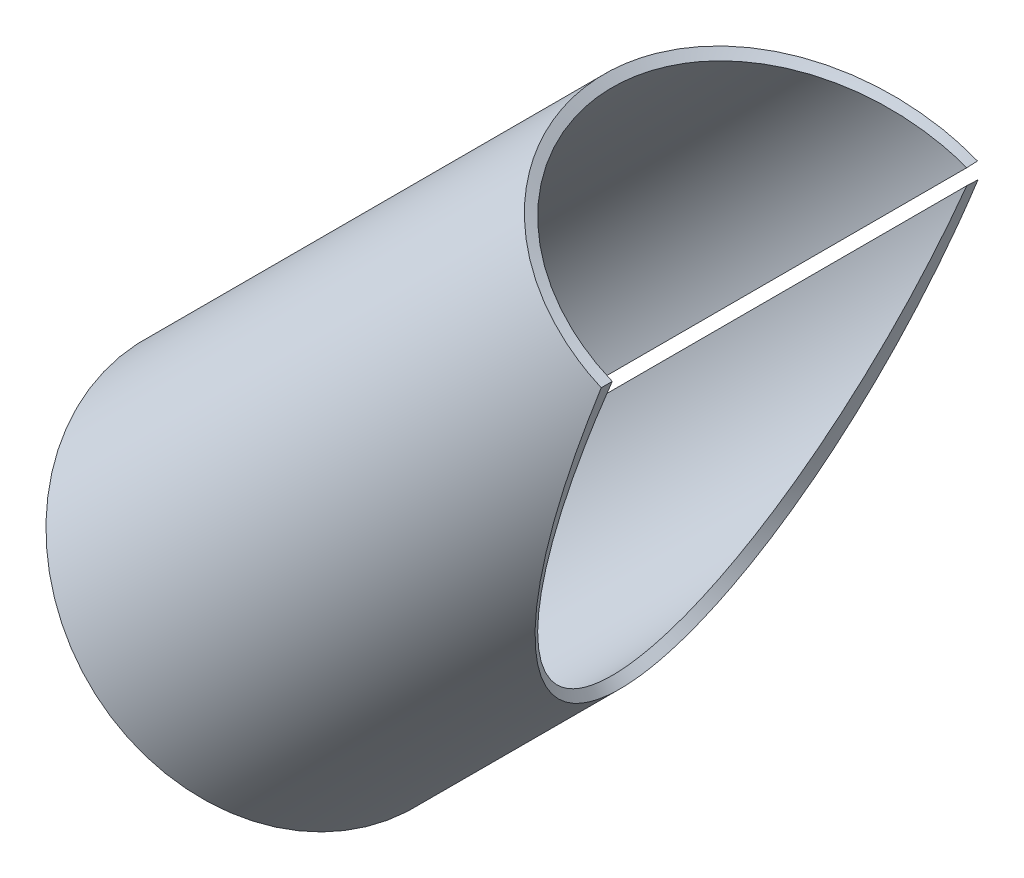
ISO-10303-21;
HEADER;
FILE_DESCRIPTION(('STEP AP214'),'2;1');
FILE_NAME('part.step','',(''),(''),'','','');
FILE_SCHEMA(('AUTOMOTIVE_DESIGN { 1 0 10303 214 1 1 1 1 }'));
ENDSEC;
DATA;
#1=APPLICATION_CONTEXT('core data for automotive mechanical design processes');
#2=APPLICATION_PROTOCOL_DEFINITION('international standard','automotive_design',2000,#1);
#3=PRODUCT_CONTEXT('',#1,'mechanical');
#4=PRODUCT('Part','Part','',(#3));
#5=PRODUCT_RELATED_PRODUCT_CATEGORY('part','',(#4));
#6=PRODUCT_DEFINITION_FORMATION('','',#4);
#7=PRODUCT_DEFINITION_CONTEXT('part definition',#1,'design');
#8=PRODUCT_DEFINITION('design','',#6,#7);
#9=PRODUCT_DEFINITION_SHAPE('','',#8);
#10=(LENGTH_UNIT() NAMED_UNIT(*) SI_UNIT(.MILLI.,.METRE.));
#11=(NAMED_UNIT(*) PLANE_ANGLE_UNIT() SI_UNIT($,.RADIAN.));
#12=(NAMED_UNIT(*) SI_UNIT($,.STERADIAN.) SOLID_ANGLE_UNIT());
#13=UNCERTAINTY_MEASURE_WITH_UNIT(LENGTH_MEASURE(1.E-05),#10,'distance_accuracy_value','');
#14=(GEOMETRIC_REPRESENTATION_CONTEXT(3) GLOBAL_UNCERTAINTY_ASSIGNED_CONTEXT((#13)) GLOBAL_UNIT_ASSIGNED_CONTEXT((#10,
#11,#12)) REPRESENTATION_CONTEXT('',''));
#15=CARTESIAN_POINT('',(0.,0.,0.));
#16=DIRECTION('',(0.,0.,1.));
#17=DIRECTION('',(1.,0.,0.));
#18=AXIS2_PLACEMENT_3D('',#15,#16,#17);
#19=CARTESIAN_POINT('',(-0.47839322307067,-1.22871355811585,-17.354970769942));
#20=CARTESIAN_POINT('',(-1.06470846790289,-2.7347071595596,-17.3350902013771));
#21=CARTESIAN_POINT('',(-1.5784804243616,-4.05532095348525,-17.2815846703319));
#22=CARTESIAN_POINT('',(-2.24140156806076,-5.75741045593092,-17.1859346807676));
#23=CARTESIAN_POINT('',(-2.44436622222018,-6.27833709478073,-17.1513858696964));
#24=CARTESIAN_POINT('',(-2.67541125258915,-6.87159919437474,-17.1077527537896));
#25=CARTESIAN_POINT('',(-2.72043684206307,-6.98723120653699,-17.0990149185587));
#26=CARTESIAN_POINT('',(-2.81056451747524,-7.21869836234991,-17.0810788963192));
#27=CARTESIAN_POINT('',(-2.85537545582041,-7.33378882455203,-17.0719341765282));
#28=CARTESIAN_POINT('',(-2.98905117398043,-7.6771292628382,-17.0439895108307));
#29=CARTESIAN_POINT('',(-3.07715892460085,-7.90344822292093,-17.024679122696));
#30=CARTESIAN_POINT('',(-3.51266788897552,-9.02215251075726,-16.9249819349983));
#31=CARTESIAN_POINT('',(-3.84499884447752,-9.87584719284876,-16.8351810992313));
#32=CARTESIAN_POINT('',(-4.31946970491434,-11.094397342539,-16.6901101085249));
#33=CARTESIAN_POINT('',(-4.47361854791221,-11.4902525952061,-16.6400204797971));
#34=CARTESIAN_POINT('',(-4.77387356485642,-12.2613332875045,-16.5371046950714));
#35=CARTESIAN_POINT('',(-4.91944011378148,-12.6351923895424,-16.4844908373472));
#36=CARTESIAN_POINT('',(-5.637711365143,-14.4801528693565,-16.2122108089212));
#37=CARTESIAN_POINT('',(-6.17670202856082,-15.8646910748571,-15.9664945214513));
#38=CARTESIAN_POINT('',(-6.93194289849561,-17.8041587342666,-15.5714230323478));
#39=CARTESIAN_POINT('',(-7.17416444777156,-18.4262287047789,-15.4356943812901));
#40=CARTESIAN_POINT('',(-7.64705217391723,-19.6408786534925,-15.1538509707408));
#41=CARTESIAN_POINT('',(-7.87709491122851,-20.2317899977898,-15.0080407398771));
#42=CARTESIAN_POINT('',(-8.32442503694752,-21.380738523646,-14.7080546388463));
#43=CARTESIAN_POINT('',(-8.54171218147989,-21.9387759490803,-14.5538789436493));
#44=CARTESIAN_POINT('',(-8.96350448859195,-23.0220032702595,-14.2385166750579));
#45=CARTESIAN_POINT('',(-9.16762390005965,-23.5462277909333,-14.0776444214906));
#46=CARTESIAN_POINT('',(-9.76387695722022,-25.0778219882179,-13.583844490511));
#47=CARTESIAN_POINT('',(-10.1403882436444,-26.0450871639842,-13.2393083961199));
#48=CARTESIAN_POINT('',(-10.6738347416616,-27.4151227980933,-12.7047930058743));
#49=CARTESIAN_POINT('',(-10.8464249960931,-27.8583294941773,-12.5236660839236));
#50=CARTESIAN_POINT('',(-11.1811244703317,-28.7178297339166,-12.1563417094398));
#51=CARTESIAN_POINT('',(-11.3430615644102,-29.1336963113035,-11.9703529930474));
#52=CARTESIAN_POINT('',(-11.8152078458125,-30.3464859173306,-11.4033826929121));
#53=CARTESIAN_POINT('',(-12.1113227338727,-31.1072926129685,-11.0139293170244));
#54=CARTESIAN_POINT('',(-12.6664849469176,-32.5332355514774,-10.2169557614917));
#55=CARTESIAN_POINT('',(-12.9255309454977,-33.1983731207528,-9.80943710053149));
#56=CARTESIAN_POINT('',(-13.4064174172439,-34.4331157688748,-8.98098543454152));
#57=CARTESIAN_POINT('',(-13.6287586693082,-35.0043178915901,-8.55893390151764));
#58=CARTESIAN_POINT('',(-14.2438724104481,-36.5846792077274,-7.27084148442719));
#59=CARTESIAN_POINT('',(-14.5840579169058,-37.4581121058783,-6.3846337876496));
#60=CARTESIAN_POINT('',(-14.9891684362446,-38.4983817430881,-5.03582187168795));
#61=CARTESIAN_POINT('',(-15.1067505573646,-38.800524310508,-4.58259505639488));
#62=CARTESIAN_POINT('',(-15.3082281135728,-39.3180518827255,-3.66903476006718));
#63=CARTESIAN_POINT('',(-15.3919680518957,-39.5330666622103,-3.20913863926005));
#64=CARTESIAN_POINT('',(-15.5920985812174,-40.0469567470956,-1.82483459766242));
#65=CARTESIAN_POINT('',(-15.6576664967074,-40.2155988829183,-0.893090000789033));
#66=CARTESIAN_POINT('',(-15.6541279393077,-40.2062799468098,0.969302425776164));
#67=CARTESIAN_POINT('',(-15.5847007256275,-40.028147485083,1.90014050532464));
#68=CARTESIAN_POINT('',(-15.3105088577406,-39.3237507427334,3.74615613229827));
#69=CARTESIAN_POINT('',(-15.105620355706,-38.7976891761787,4.6602344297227));
#70=CARTESIAN_POINT('',(-14.6953382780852,-37.7437813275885,6.00713941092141));
#71=CARTESIAN_POINT('',(-14.5416019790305,-37.3489034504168,6.45134647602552));
#72=CARTESIAN_POINT('',(-14.1982222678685,-36.4672929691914,7.33148120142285));
#73=CARTESIAN_POINT('',(-14.0087943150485,-35.9809346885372,7.76697087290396));
#74=CARTESIAN_POINT('',(-13.5945729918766,-34.9170012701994,8.6249834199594));
#75=CARTESIAN_POINT('',(-13.3697803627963,-34.3394253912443,9.04750523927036));
#76=CARTESIAN_POINT('',(-12.884676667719,-33.0932097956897,9.87562412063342));
#77=CARTESIAN_POINT('',(-12.6244304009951,-32.4249547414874,10.2810797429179));
#78=CARTESIAN_POINT('',(-12.064751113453,-30.9877266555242,11.0766186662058));
#79=CARTESIAN_POINT('',(-11.7658081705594,-30.2199025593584,11.4659163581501));
#80=CARTESIAN_POINT('',(-11.2887331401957,-28.9943570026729,12.0332384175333));
#81=CARTESIAN_POINT('',(-11.1249281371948,-28.5735434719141,12.2195727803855));
#82=CARTESIAN_POINT('',(-10.787716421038,-27.707361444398,12.586018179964));
#83=CARTESIAN_POINT('',(-10.6141604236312,-27.2616425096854,12.7662929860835));
#84=CARTESIAN_POINT('',(-10.0764786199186,-25.8808056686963,13.2993378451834));
#85=CARTESIAN_POINT('',(-9.6962067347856,-24.9041125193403,13.6434411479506));
#86=CARTESIAN_POINT('',(-9.09308534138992,-23.3548574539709,14.136980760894));
#87=CARTESIAN_POINT('',(-8.8867729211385,-22.8248910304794,14.2975816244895));
#88=CARTESIAN_POINT('',(-8.46236647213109,-21.7348941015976,14.6108320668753));
#89=CARTESIAN_POINT('',(-8.24343150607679,-21.172662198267,14.7641073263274));
#90=CARTESIAN_POINT('',(-7.56652518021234,-19.4341723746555,15.2116878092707));
#91=CARTESIAN_POINT('',(-7.08849729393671,-18.2060754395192,15.4937783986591));
#92=CARTESIAN_POINT('',(-6.07844529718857,-15.6121563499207,16.0128578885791));
#93=CARTESIAN_POINT('',(-5.53530600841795,-14.2172778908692,16.2557855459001));
#94=CARTESIAN_POINT('',(-4.80843496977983,-12.3501130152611,16.5247373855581));
#95=CARTESIAN_POINT('',(-4.6606631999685,-11.9705264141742,16.576782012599));
#96=CARTESIAN_POINT('',(-4.43538865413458,-11.3919366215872,16.6519453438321));
#97=CARTESIAN_POINT('',(-4.35985979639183,-11.1979660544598,16.6764660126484));
#98=CARTESIAN_POINT('',(-4.20596937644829,-10.8027821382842,16.7249932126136));
#99=CARTESIAN_POINT('',(-4.12776887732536,-10.6019787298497,16.7489438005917));
#100=CARTESIAN_POINT('',(-3.73050751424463,-9.58188685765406,16.8668375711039));
#101=CARTESIAN_POINT('',(-3.3926934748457,-8.71435047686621,16.9552397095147));
#102=CARTESIAN_POINT('',(-2.85604056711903,-7.33577600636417,17.0728850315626));
#103=CARTESIAN_POINT('',(-2.67216299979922,-6.86337748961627,17.1095998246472));
#104=CARTESIAN_POINT('',(-2.38881800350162,-6.13550792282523,17.1600967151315));
#105=CARTESIAN_POINT('',(-2.29342364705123,-5.89046185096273,17.1761180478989));
#106=CARTESIAN_POINT('',(-2.09885937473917,-5.39075796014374,17.2066869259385));
#107=CARTESIAN_POINT('',(-1.99170232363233,-5.11571772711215,17.2224796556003));
#108=CARTESIAN_POINT('',(-1.64073724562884,-4.21490134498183,17.2693805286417));
#109=CARTESIAN_POINT('',(-1.36746064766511,-3.51340415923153,17.3001344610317));
#110=CARTESIAN_POINT('',(-0.742617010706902,-1.9081946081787,17.3469854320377));
#111=CARTESIAN_POINT('',(-0.391082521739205,-1.0044679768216,17.3630786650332));
#112=CARTESIAN_POINT('',(0.,0.,17.3630786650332));
#113=CARTESIAN_POINT('',(-0.500000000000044,-1.20710678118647,-16.3554377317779));
#114=CARTESIAN_POINT('',(-1.11279701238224,-2.68661189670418,-16.336702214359));
#115=CARTESIAN_POINT('',(-1.64980534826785,-3.98399602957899,-16.2862781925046));
#116=CARTESIAN_POINT('',(-2.3426511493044,-5.65616087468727,-16.1961370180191));
#117=CARTESIAN_POINT('',(-2.55477207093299,-6.16793124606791,-16.163577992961));
#118=CARTESIAN_POINT('',(-2.79624777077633,-6.75076267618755,-16.1224578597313));
#119=CARTESIAN_POINT('',(-2.84330659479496,-6.86436145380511,-16.1142232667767));
#120=CARTESIAN_POINT('',(-2.93750438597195,-7.0917584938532,-16.0973202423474));
#121=CARTESIAN_POINT('',(-2.98433914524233,-7.2048251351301,-16.0887021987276));
#122=CARTESIAN_POINT('',(-3.12405252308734,-7.54212791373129,-16.0623669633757));
#123=CARTESIAN_POINT('',(-3.21614030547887,-7.76446684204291,-16.0441687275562));
#124=CARTESIAN_POINT('',(-3.67132306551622,-8.86349733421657,-15.9502134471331));
#125=CARTESIAN_POINT('',(-4.01866759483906,-9.70217844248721,-15.8655845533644));
#126=CARTESIAN_POINT('',(-4.51456551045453,-10.8993015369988,-15.7288687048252));
#127=CARTESIAN_POINT('',(-4.67567470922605,-11.2881964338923,-15.6816639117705));
#128=CARTESIAN_POINT('',(-4.9894879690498,-12.0457188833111,-15.5846754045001));
#129=CARTESIAN_POINT('',(-5.1416285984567,-12.4130039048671,-15.5350917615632));
#130=CARTESIAN_POINT('',(-5.89234482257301,-14.2255194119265,-15.2784932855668));
#131=CARTESIAN_POINT('',(-6.45568449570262,-15.5857086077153,-15.0469286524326));
#132=CARTESIAN_POINT('',(-7.24502723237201,-17.4910744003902,-14.6746107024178));
#133=CARTESIAN_POINT('',(-7.49818717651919,-18.1022059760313,-14.5466991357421));
#134=CARTESIAN_POINT('',(-7.99243523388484,-19.2954955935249,-14.2810880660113));
#135=CARTESIAN_POINT('',(-8.23286980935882,-19.8760150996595,-14.1436755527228));
#136=CARTESIAN_POINT('',(-8.70040425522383,-21.0047593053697,-13.8609666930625));
#137=CARTESIAN_POINT('',(-8.92750389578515,-21.552984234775,-13.7156705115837));
#138=CARTESIAN_POINT('',(-9.36834337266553,-22.6171643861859,-13.418471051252));
#139=CARTESIAN_POINT('',(-9.58168076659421,-23.1321709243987,-13.2668639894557));
#140=CARTESIAN_POINT('',(-10.2048685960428,-24.6368303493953,-12.8015037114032));
#141=CARTESIAN_POINT('',(-10.5983916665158,-25.5870837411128,-12.4768106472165));
#142=CARTESIAN_POINT('',(-11.1559292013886,-26.9330283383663,-11.9730798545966));
#143=CARTESIAN_POINT('',(-11.3363123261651,-27.3684421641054,-11.802384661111));
#144=CARTESIAN_POINT('',(-11.6861243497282,-28.2128298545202,-11.4562157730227));
#145=CARTESIAN_POINT('',(-11.8553737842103,-28.6213840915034,-11.2809387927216));
#146=CARTESIAN_POINT('',(-12.3488481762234,-29.8128455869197,-10.7466222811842));
#147=CARTESIAN_POINT('',(-12.6583446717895,-30.5602706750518,-10.379598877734));
#148=CARTESIAN_POINT('',(-13.2385825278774,-31.9611379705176,-9.62852579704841));
#149=CARTESIAN_POINT('',(-13.5093226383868,-32.6145814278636,-9.24447755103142));
#150=CARTESIAN_POINT('',(-14.0119177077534,-33.8276154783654,-8.46373929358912));
#151=CARTESIAN_POINT('',(-14.2443050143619,-34.3887715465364,-8.06599517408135));
#152=CARTESIAN_POINT('',(-14.8872147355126,-35.9413368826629,-6.85208847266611));
#153=CARTESIAN_POINT('',(-15.242756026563,-36.7994139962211,-6.01692055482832));
#154=CARTESIAN_POINT('',(-15.6661570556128,-37.8213931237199,-4.74579140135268));
#155=CARTESIAN_POINT('',(-15.789053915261,-38.1182209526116,-4.31866749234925));
#156=CARTESIAN_POINT('',(-15.9996326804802,-38.6266473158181,-3.4577223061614));
#157=CARTESIAN_POINT('',(-16.0871529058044,-38.8378818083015,-3.02431320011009));
#158=CARTESIAN_POINT('',(-16.2963186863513,-39.3427366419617,-1.71973603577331));
#159=CARTESIAN_POINT('',(-16.3648548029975,-39.5084105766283,-0.841653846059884));
#160=CARTESIAN_POINT('',(-16.3611497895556,-39.499258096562,0.913476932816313));
#161=CARTESIAN_POINT('',(-16.2885922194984,-39.3242559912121,1.79070481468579));
#162=CARTESIAN_POINT('',(-16.002011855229,-38.6322477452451,3.53040199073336));
#163=CARTESIAN_POINT('',(-15.7878746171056,-38.115434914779,4.39183534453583));
#164=CARTESIAN_POINT('',(-15.3590582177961,-37.0800613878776,5.66116739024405));
#165=CARTESIAN_POINT('',(-15.1983778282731,-36.6921276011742,6.07979102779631));
#166=CARTESIAN_POINT('',(-14.8394988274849,-35.826016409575,6.90923573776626));
#167=CARTESIAN_POINT('',(-14.641520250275,-35.3482087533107,7.31964404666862));
#168=CARTESIAN_POINT('',(-14.2085893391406,-34.3029849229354,8.12824067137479));
#169=CARTESIAN_POINT('',(-13.9736377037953,-33.7355680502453,8.52642799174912));
#170=CARTESIAN_POINT('',(-13.4666164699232,-32.5112699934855,9.30685263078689));
#171=CARTESIAN_POINT('',(-13.1946208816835,-31.854764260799,9.68895665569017));
#172=CARTESIAN_POINT('',(-12.6096710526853,-30.4428067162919,10.4386777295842));
#173=CARTESIAN_POINT('',(-12.2972258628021,-29.6884848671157,10.8055544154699));
#174=CARTESIAN_POINT('',(-11.7985973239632,-28.4844928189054,11.3402024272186));
#175=CARTESIAN_POINT('',(-11.6273913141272,-28.0710802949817,11.5158051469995));
#176=CARTESIAN_POINT('',(-11.2749469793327,-27.2201308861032,11.8611456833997));
#177=CARTESIAN_POINT('',(-11.0935535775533,-26.7822493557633,12.0310378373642));
#178=CARTESIAN_POINT('',(-10.5315916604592,-25.4256926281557,12.5333827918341));
#179=CARTESIAN_POINT('',(-10.1341447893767,-24.4661744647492,12.8576679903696));
#180=CARTESIAN_POINT('',(-9.50377783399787,-22.9441649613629,13.3227829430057));
#181=CARTESIAN_POINT('',(-9.28814523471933,-22.4235187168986,13.4741342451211));
#182=CARTESIAN_POINT('',(-8.84457195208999,-21.3526886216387,13.7693435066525));
#183=CARTESIAN_POINT('',(-8.61575115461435,-20.8003425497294,13.9137911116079));
#184=CARTESIAN_POINT('',(-7.90827468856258,-19.0924228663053,14.3355938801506));
#185=CARTESIAN_POINT('',(-7.40864726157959,-17.8859254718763,14.6014378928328));
#186=CARTESIAN_POINT('',(-6.35298506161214,-15.3376165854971,15.0906217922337));
#187=CARTESIAN_POINT('',(-5.78531846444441,-13.9672654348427,15.3195584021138));
#188=CARTESIAN_POINT('',(-5.02561068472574,-12.1329373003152,15.5730203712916));
#189=CARTESIAN_POINT('',(-4.87116340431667,-11.760026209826,15.6220675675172));
#190=CARTESIAN_POINT('',(-4.63571453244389,-11.1916107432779,15.6929019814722));
#191=CARTESIAN_POINT('',(-4.55677494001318,-11.0010509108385,15.7160104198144));
#192=CARTESIAN_POINT('',(-4.39593605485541,-10.6128154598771,15.761742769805));
#193=CARTESIAN_POINT('',(-4.31420499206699,-10.4155426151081,15.7843139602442));
#194=CARTESIAN_POINT('',(-3.89900814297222,-9.41338622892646,15.8954178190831));
#195=CARTESIAN_POINT('',(-3.54593982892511,-8.5611041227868,15.9787285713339));
#196=CARTESIAN_POINT('',(-2.98504232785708,-7.20677424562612,16.0895982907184));
#197=CARTESIAN_POINT('',(-2.79285629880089,-6.74268419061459,16.1241985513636));
#198=CARTESIAN_POINT('',(-2.49671044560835,-6.0276154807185,16.1717871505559));
#199=CARTESIAN_POINT('',(-2.39700660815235,-5.78687888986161,16.1868857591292));
#200=CARTESIAN_POINT('',(-2.19365531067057,-5.29596202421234,16.2156940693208));
#201=CARTESIAN_POINT('',(-2.08166377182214,-5.02575627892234,16.2305772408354));
#202=CARTESIAN_POINT('',(-1.71486477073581,-4.14077381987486,16.2747769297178));
#203=CARTESIAN_POINT('',(-1.42925681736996,-3.45160798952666,16.3037596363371));
#204=CARTESIAN_POINT('',(-0.776181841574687,-1.87462977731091,16.3479122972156));
#205=CARTESIAN_POINT('',(-0.408745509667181,-0.98680324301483,16.3630786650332));
#206=CARTESIAN_POINT('',(0.,0.,16.3630786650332));
#207=B_SPLINE_SURFACE_WITH_KNOTS('',1,3,((#19,#20,#21,#22,#23,#24,#25,#26,#27,#28,#29,#30,#31,
#32,#33,#34,#35,#36,#37,#38,#39,#40,#41,#42,#43,#44,#45,#46,#47,#48,#49,#50,#51,#52,#53,#54,#55,
#56,#57,#58,#59,#60,#61,#62,#63,#64,#65,#66,#67,#68,#69,#70,#71,#72,#73,#74,#75,#76,#77,#78,#79,
#80,#81,#82,#83,#84,#85,#86,#87,#88,#89,#90,#91,#92,#93,#94,#95,#96,#97,#98,#99,#100,#101,#102,
#103,#104,#105,#106,#107,#108,#109,#110,#111,#112),(#113,#114,#115,#116,#117,#118,#119,#120,
#121,#122,#123,#124,#125,#126,#127,#128,#129,#130,#131,#132,#133,#134,#135,#136,#137,#138,#139,
#140,#141,#142,#143,#144,#145,#146,#147,#148,#149,#150,#151,#152,#153,#154,#155,#156,#157,#158,
#159,#160,#161,#162,#163,#164,#165,#166,#167,#168,#169,#170,#171,#172,#173,#174,#175,#176,#177,
#178,#179,#180,#181,#182,#183,#184,#185,#186,#187,#188,#189,#190,#191,#192,#193,#194,#195,#196,
#197,#198,#199,#200,#201,#202,#203,#204,#205,#206)),.UNSPECIFIED.,.F.,.F.,.F.,(2,2),(4,2,2,2,2,
2,2,2,2,2,2,2,2,2,2,2,2,2,2,2,2,2,2,2,2,2,2,2,2,2,2,2,2,2,2,2,2,2,2,2,2,2,2,2,2,2,4),(0.,1.),
(0.,0.015625,0.0234375,0.025390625,0.02734375,0.03125,0.046875,0.0546875,0.0625,0.09375,
0.109375,0.125,0.140625,0.15625,0.1875,0.203125,0.21875,0.25,0.28125,0.3125,0.375,0.40625,
0.4375,0.5,0.5625,0.625,0.65625,0.6875,0.71875,0.75,0.78125,0.796875,0.8125,0.84375,0.859375,
0.875,0.90625,0.9375,0.9453125,0.94921875,0.953125,0.96875,0.9765625,0.98046875,0.984375,
0.9921875,1.),.UNSPECIFIED.);
#208=CARTESIAN_POINT('',(-0.47839322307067,-1.22871355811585,-17.354970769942));
#209=CARTESIAN_POINT('',(-0.500000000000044,-1.20710678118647,-16.3554377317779));
#210=B_SPLINE_CURVE_WITH_KNOTS('',1,(#208,#209),.UNSPECIFIED.,.F.,.F.,(2,2),(0.,1.),.UNSPECIFIED.);
#211=CARTESIAN_POINT('',(-0.500000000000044,-1.20710678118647,-16.3554377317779));
#212=VERTEX_POINT('',#211);
#213=CARTESIAN_POINT('',(-0.478393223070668,-1.22871355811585,-17.354970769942));
#214=VERTEX_POINT('',#213);
#215=EDGE_CURVE('E13',#212,#214,#210,.F.);
#216=CARTESIAN_POINT('',(-0.500000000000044,-1.20710678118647,-16.3554377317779));
#217=CARTESIAN_POINT('',(-1.11279701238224,-2.68661189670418,-16.336702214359));
#218=CARTESIAN_POINT('',(-1.64980534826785,-3.98399602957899,-16.2862781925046));
#219=CARTESIAN_POINT('',(-2.3426511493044,-5.65616087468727,-16.1961370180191));
#220=CARTESIAN_POINT('',(-2.55477207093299,-6.16793124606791,-16.163577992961));
#221=CARTESIAN_POINT('',(-2.79624777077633,-6.75076267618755,-16.1224578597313));
#222=CARTESIAN_POINT('',(-2.84330659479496,-6.86436145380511,-16.1142232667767));
#223=CARTESIAN_POINT('',(-2.93750438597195,-7.0917584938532,-16.0973202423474));
#224=CARTESIAN_POINT('',(-2.98433914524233,-7.2048251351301,-16.0887021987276));
#225=CARTESIAN_POINT('',(-3.12405252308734,-7.54212791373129,-16.0623669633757));
#226=CARTESIAN_POINT('',(-3.21614030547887,-7.76446684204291,-16.0441687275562));
#227=CARTESIAN_POINT('',(-3.67132306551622,-8.86349733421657,-15.9502134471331));
#228=CARTESIAN_POINT('',(-4.01866759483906,-9.70217844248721,-15.8655845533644));
#229=CARTESIAN_POINT('',(-4.51456551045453,-10.8993015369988,-15.7288687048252));
#230=CARTESIAN_POINT('',(-4.67567470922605,-11.2881964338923,-15.6816639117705));
#231=CARTESIAN_POINT('',(-4.9894879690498,-12.0457188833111,-15.5846754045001));
#232=CARTESIAN_POINT('',(-5.1416285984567,-12.4130039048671,-15.5350917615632));
#233=CARTESIAN_POINT('',(-5.89234482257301,-14.2255194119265,-15.2784932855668));
#234=CARTESIAN_POINT('',(-6.45568449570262,-15.5857086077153,-15.0469286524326));
#235=CARTESIAN_POINT('',(-7.24502723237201,-17.4910744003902,-14.6746107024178));
#236=CARTESIAN_POINT('',(-7.49818717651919,-18.1022059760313,-14.5466991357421));
#237=CARTESIAN_POINT('',(-7.99243523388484,-19.2954955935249,-14.2810880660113));
#238=CARTESIAN_POINT('',(-8.23286980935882,-19.8760150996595,-14.1436755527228));
#239=CARTESIAN_POINT('',(-8.70040425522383,-21.0047593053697,-13.8609666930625));
#240=CARTESIAN_POINT('',(-8.92750389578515,-21.552984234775,-13.7156705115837));
#241=CARTESIAN_POINT('',(-9.36834337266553,-22.6171643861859,-13.418471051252));
#242=CARTESIAN_POINT('',(-9.58168076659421,-23.1321709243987,-13.2668639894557));
#243=CARTESIAN_POINT('',(-10.2048685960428,-24.6368303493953,-12.8015037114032));
#244=CARTESIAN_POINT('',(-10.5983916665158,-25.5870837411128,-12.4768106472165));
#245=CARTESIAN_POINT('',(-11.1559292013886,-26.9330283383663,-11.9730798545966));
#246=CARTESIAN_POINT('',(-11.3363123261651,-27.3684421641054,-11.802384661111));
#247=CARTESIAN_POINT('',(-11.6861243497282,-28.2128298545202,-11.4562157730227));
#248=CARTESIAN_POINT('',(-11.8553737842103,-28.6213840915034,-11.2809387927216));
#249=CARTESIAN_POINT('',(-12.3488481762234,-29.8128455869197,-10.7466222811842));
#250=CARTESIAN_POINT('',(-12.6583446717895,-30.5602706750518,-10.379598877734));
#251=CARTESIAN_POINT('',(-13.2385825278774,-31.9611379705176,-9.62852579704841));
#252=CARTESIAN_POINT('',(-13.5093226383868,-32.6145814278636,-9.24447755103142));
#253=CARTESIAN_POINT('',(-14.0119177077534,-33.8276154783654,-8.46373929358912));
#254=CARTESIAN_POINT('',(-14.2443050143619,-34.3887715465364,-8.06599517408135));
#255=CARTESIAN_POINT('',(-14.8872147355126,-35.9413368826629,-6.85208847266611));
#256=CARTESIAN_POINT('',(-15.242756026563,-36.7994139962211,-6.01692055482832));
#257=CARTESIAN_POINT('',(-15.6661570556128,-37.8213931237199,-4.74579140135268));
#258=CARTESIAN_POINT('',(-15.789053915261,-38.1182209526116,-4.31866749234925));
#259=CARTESIAN_POINT('',(-15.9996326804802,-38.6266473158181,-3.4577223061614));
#260=CARTESIAN_POINT('',(-16.0871529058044,-38.8378818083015,-3.02431320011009));
#261=CARTESIAN_POINT('',(-16.2963186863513,-39.3427366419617,-1.71973603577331));
#262=CARTESIAN_POINT('',(-16.3648548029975,-39.5084105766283,-0.841653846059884));
#263=CARTESIAN_POINT('',(-16.3611497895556,-39.499258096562,0.913476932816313));
#264=CARTESIAN_POINT('',(-16.2885922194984,-39.3242559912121,1.79070481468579));
#265=CARTESIAN_POINT('',(-16.002011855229,-38.6322477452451,3.53040199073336));
#266=CARTESIAN_POINT('',(-15.7878746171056,-38.115434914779,4.39183534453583));
#267=CARTESIAN_POINT('',(-15.3590582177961,-37.0800613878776,5.66116739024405));
#268=CARTESIAN_POINT('',(-15.1983778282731,-36.6921276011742,6.07979102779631));
#269=CARTESIAN_POINT('',(-14.8394988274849,-35.826016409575,6.90923573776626));
#270=CARTESIAN_POINT('',(-14.641520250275,-35.3482087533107,7.31964404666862));
#271=CARTESIAN_POINT('',(-14.2085893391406,-34.3029849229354,8.12824067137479));
#272=CARTESIAN_POINT('',(-13.9736377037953,-33.7355680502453,8.52642799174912));
#273=CARTESIAN_POINT('',(-13.4666164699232,-32.5112699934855,9.30685263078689));
#274=CARTESIAN_POINT('',(-13.1946208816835,-31.854764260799,9.68895665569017));
#275=CARTESIAN_POINT('',(-12.6096710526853,-30.4428067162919,10.4386777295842));
#276=CARTESIAN_POINT('',(-12.2972258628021,-29.6884848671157,10.8055544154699));
#277=CARTESIAN_POINT('',(-11.7985973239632,-28.4844928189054,11.3402024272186));
#278=CARTESIAN_POINT('',(-11.6273913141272,-28.0710802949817,11.5158051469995));
#279=CARTESIAN_POINT('',(-11.2749469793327,-27.2201308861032,11.8611456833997));
#280=CARTESIAN_POINT('',(-11.0935535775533,-26.7822493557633,12.0310378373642));
#281=CARTESIAN_POINT('',(-10.5315916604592,-25.4256926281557,12.5333827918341));
#282=CARTESIAN_POINT('',(-10.1341447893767,-24.4661744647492,12.8576679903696));
#283=CARTESIAN_POINT('',(-9.50377783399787,-22.9441649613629,13.3227829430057));
#284=CARTESIAN_POINT('',(-9.28814523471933,-22.4235187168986,13.4741342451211));
#285=CARTESIAN_POINT('',(-8.84457195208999,-21.3526886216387,13.7693435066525));
#286=CARTESIAN_POINT('',(-8.61575115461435,-20.8003425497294,13.9137911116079));
#287=CARTESIAN_POINT('',(-7.90827468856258,-19.0924228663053,14.3355938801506));
#288=CARTESIAN_POINT('',(-7.40864726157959,-17.8859254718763,14.6014378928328));
#289=CARTESIAN_POINT('',(-6.35298506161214,-15.3376165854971,15.0906217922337));
#290=CARTESIAN_POINT('',(-5.78531846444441,-13.9672654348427,15.3195584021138));
#291=CARTESIAN_POINT('',(-5.02561068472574,-12.1329373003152,15.5730203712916));
#292=CARTESIAN_POINT('',(-4.87116340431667,-11.760026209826,15.6220675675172));
#293=CARTESIAN_POINT('',(-4.63571453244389,-11.1916107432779,15.6929019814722));
#294=CARTESIAN_POINT('',(-4.55677494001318,-11.0010509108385,15.7160104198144));
#295=CARTESIAN_POINT('',(-4.39593605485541,-10.6128154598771,15.761742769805));
#296=CARTESIAN_POINT('',(-4.31420499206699,-10.4155426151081,15.7843139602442));
#297=CARTESIAN_POINT('',(-3.89900814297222,-9.41338622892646,15.8954178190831));
#298=CARTESIAN_POINT('',(-3.54593982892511,-8.5611041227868,15.9787285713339));
#299=CARTESIAN_POINT('',(-2.98504232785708,-7.20677424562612,16.0895982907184));
#300=CARTESIAN_POINT('',(-2.79285629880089,-6.74268419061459,16.1241985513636));
#301=CARTESIAN_POINT('',(-2.49671044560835,-6.0276154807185,16.1717871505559));
#302=CARTESIAN_POINT('',(-2.39700660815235,-5.78687888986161,16.1868857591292));
#303=CARTESIAN_POINT('',(-2.19365531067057,-5.29596202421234,16.2156940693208));
#304=CARTESIAN_POINT('',(-2.08166377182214,-5.02575627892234,16.2305772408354));
#305=CARTESIAN_POINT('',(-1.71486477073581,-4.14077381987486,16.2747769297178));
#306=CARTESIAN_POINT('',(-1.42925681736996,-3.45160798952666,16.3037596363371));
#307=CARTESIAN_POINT('',(-0.776181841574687,-1.87462977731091,16.3479122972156));
#308=CARTESIAN_POINT('',(-0.408745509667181,-0.98680324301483,16.3630786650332));
#309=CARTESIAN_POINT('',(0.,0.,16.3630786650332));
#310=B_SPLINE_CURVE_WITH_KNOTS('',3,(#216,#217,#218,#219,#220,#221,#222,#223,#224,#225,#226,
#227,#228,#229,#230,#231,#232,#233,#234,#235,#236,#237,#238,#239,#240,#241,#242,#243,#244,#245,
#246,#247,#248,#249,#250,#251,#252,#253,#254,#255,#256,#257,#258,#259,#260,#261,#262,#263,#264,
#265,#266,#267,#268,#269,#270,#271,#272,#273,#274,#275,#276,#277,#278,#279,#280,#281,#282,#283,
#284,#285,#286,#287,#288,#289,#290,#291,#292,#293,#294,#295,#296,#297,#298,#299,#300,#301,#302,
#303,#304,#305,#306,#307,#308,#309),.UNSPECIFIED.,.F.,.F.,(4,2,2,2,2,2,2,2,2,2,2,2,2,2,2,2,2,2,
2,2,2,2,2,2,2,2,2,2,2,2,2,2,2,2,2,2,2,2,2,2,2,2,2,2,2,2,4),(0.,0.015625,0.0234375,0.025390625,
0.02734375,0.03125,0.046875,0.0546875,0.0625,0.09375,0.109375,0.125,0.140625,0.15625,0.1875,
0.203125,0.21875,0.25,0.28125,0.3125,0.375,0.40625,0.4375,0.5,0.5625,0.625,0.65625,0.6875,
0.71875,0.75,0.78125,0.796875,0.8125,0.84375,0.859375,0.875,0.90625,0.9375,0.9453125,0.94921875,
0.953125,0.96875,0.9765625,0.98046875,0.984375,0.9921875,1.),.UNSPECIFIED.);
#311=CARTESIAN_POINT('',(0.,0.,16.3630786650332));
#312=VERTEX_POINT('',#311);
#313=EDGE_CURVE('E86',#212,#312,#310,.T.);
#314=CARTESIAN_POINT('',(0.,0.,16.3630786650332));
#315=CARTESIAN_POINT('',(0.,0.,17.3630786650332));
#316=B_SPLINE_CURVE_WITH_KNOTS('',1,(#314,#315),.UNSPECIFIED.,.F.,.F.,(2,2),(0.,1.),.UNSPECIFIED.);
#317=CARTESIAN_POINT('',(-1.69141156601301E-07,-4.34427233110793E-07,17.3630786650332));
#318=VERTEX_POINT('',#317);
#319=EDGE_CURVE('E49',#312,#318,#316,.T.);
#320=CARTESIAN_POINT('',(0.,0.,17.3630786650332));
#321=CARTESIAN_POINT('',(-0.391082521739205,-1.0044679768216,17.3630786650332));
#322=CARTESIAN_POINT('',(-0.742617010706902,-1.9081946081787,17.3469854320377));
#323=CARTESIAN_POINT('',(-1.36746064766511,-3.51340415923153,17.3001344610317));
#324=CARTESIAN_POINT('',(-1.64073724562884,-4.21490134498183,17.2693805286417));
#325=CARTESIAN_POINT('',(-1.99170232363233,-5.11571772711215,17.2224796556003));
#326=CARTESIAN_POINT('',(-2.09885937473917,-5.39075796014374,17.2066869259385));
#327=CARTESIAN_POINT('',(-2.29342364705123,-5.89046185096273,17.1761180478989));
#328=CARTESIAN_POINT('',(-2.38881800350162,-6.13550792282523,17.1600967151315));
#329=CARTESIAN_POINT('',(-2.67216299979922,-6.86337748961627,17.1095998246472));
#330=CARTESIAN_POINT('',(-2.85604056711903,-7.33577600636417,17.0728850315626));
#331=CARTESIAN_POINT('',(-3.3926934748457,-8.71435047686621,16.9552397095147));
#332=CARTESIAN_POINT('',(-3.73050751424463,-9.58188685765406,16.8668375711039));
#333=CARTESIAN_POINT('',(-4.12776887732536,-10.6019787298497,16.7489438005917));
#334=CARTESIAN_POINT('',(-4.20596937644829,-10.8027821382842,16.7249932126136));
#335=CARTESIAN_POINT('',(-4.35985979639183,-11.1979660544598,16.6764660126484));
#336=CARTESIAN_POINT('',(-4.43538865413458,-11.3919366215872,16.6519453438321));
#337=CARTESIAN_POINT('',(-4.6606631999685,-11.9705264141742,16.576782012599));
#338=CARTESIAN_POINT('',(-4.80843496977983,-12.3501130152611,16.5247373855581));
#339=CARTESIAN_POINT('',(-5.53530600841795,-14.2172778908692,16.2557855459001));
#340=CARTESIAN_POINT('',(-6.07844529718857,-15.6121563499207,16.0128578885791));
#341=CARTESIAN_POINT('',(-7.08849729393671,-18.2060754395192,15.4937783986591));
#342=CARTESIAN_POINT('',(-7.56652518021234,-19.4341723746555,15.2116878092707));
#343=CARTESIAN_POINT('',(-8.24343150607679,-21.172662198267,14.7641073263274));
#344=CARTESIAN_POINT('',(-8.46236647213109,-21.7348941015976,14.6108320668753));
#345=CARTESIAN_POINT('',(-8.8867729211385,-22.8248910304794,14.2975816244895));
#346=CARTESIAN_POINT('',(-9.09308534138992,-23.3548574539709,14.136980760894));
#347=CARTESIAN_POINT('',(-9.6962067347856,-24.9041125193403,13.6434411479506));
#348=CARTESIAN_POINT('',(-10.0764786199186,-25.8808056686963,13.2993378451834));
#349=CARTESIAN_POINT('',(-10.6141604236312,-27.2616425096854,12.7662929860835));
#350=CARTESIAN_POINT('',(-10.787716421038,-27.707361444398,12.586018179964));
#351=CARTESIAN_POINT('',(-11.1249281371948,-28.5735434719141,12.2195727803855));
#352=CARTESIAN_POINT('',(-11.2887331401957,-28.9943570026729,12.0332384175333));
#353=CARTESIAN_POINT('',(-11.7658081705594,-30.2199025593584,11.4659163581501));
#354=CARTESIAN_POINT('',(-12.064751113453,-30.9877266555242,11.0766186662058));
#355=CARTESIAN_POINT('',(-12.6244304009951,-32.4249547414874,10.2810797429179));
#356=CARTESIAN_POINT('',(-12.884676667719,-33.0932097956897,9.87562412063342));
#357=CARTESIAN_POINT('',(-13.3697803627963,-34.3394253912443,9.04750523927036));
#358=CARTESIAN_POINT('',(-13.5945729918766,-34.9170012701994,8.6249834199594));
#359=CARTESIAN_POINT('',(-14.0087943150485,-35.9809346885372,7.76697087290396));
#360=CARTESIAN_POINT('',(-14.1982222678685,-36.4672929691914,7.33148120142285));
#361=CARTESIAN_POINT('',(-14.5416019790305,-37.3489034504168,6.45134647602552));
#362=CARTESIAN_POINT('',(-14.6953382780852,-37.7437813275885,6.00713941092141));
#363=CARTESIAN_POINT('',(-15.105620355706,-38.7976891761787,4.6602344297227));
#364=CARTESIAN_POINT('',(-15.3105088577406,-39.3237507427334,3.74615613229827));
#365=CARTESIAN_POINT('',(-15.5847007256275,-40.028147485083,1.90014050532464));
#366=CARTESIAN_POINT('',(-15.6541279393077,-40.2062799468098,0.969302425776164));
#367=CARTESIAN_POINT('',(-15.6576664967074,-40.2155988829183,-0.893090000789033));
#368=CARTESIAN_POINT('',(-15.5920985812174,-40.0469567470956,-1.82483459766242));
#369=CARTESIAN_POINT('',(-15.3919680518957,-39.5330666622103,-3.20913863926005));
#370=CARTESIAN_POINT('',(-15.3082281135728,-39.3180518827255,-3.66903476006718));
#371=CARTESIAN_POINT('',(-15.1067505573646,-38.800524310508,-4.58259505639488));
#372=CARTESIAN_POINT('',(-14.9891684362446,-38.4983817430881,-5.03582187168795));
#373=CARTESIAN_POINT('',(-14.5840579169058,-37.4581121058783,-6.3846337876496));
#374=CARTESIAN_POINT('',(-14.2438724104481,-36.5846792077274,-7.27084148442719));
#375=CARTESIAN_POINT('',(-13.6287586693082,-35.0043178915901,-8.55893390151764));
#376=CARTESIAN_POINT('',(-13.4064174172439,-34.4331157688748,-8.98098543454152));
#377=CARTESIAN_POINT('',(-12.9255309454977,-33.1983731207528,-9.80943710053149));
#378=CARTESIAN_POINT('',(-12.6664849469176,-32.5332355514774,-10.2169557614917));
#379=CARTESIAN_POINT('',(-12.1113227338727,-31.1072926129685,-11.0139293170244));
#380=CARTESIAN_POINT('',(-11.8152078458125,-30.3464859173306,-11.4033826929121));
#381=CARTESIAN_POINT('',(-11.3430615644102,-29.1336963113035,-11.9703529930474));
#382=CARTESIAN_POINT('',(-11.1811244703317,-28.7178297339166,-12.1563417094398));
#383=CARTESIAN_POINT('',(-10.8464249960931,-27.8583294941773,-12.5236660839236));
#384=CARTESIAN_POINT('',(-10.6738347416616,-27.4151227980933,-12.7047930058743));
#385=CARTESIAN_POINT('',(-10.1403882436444,-26.0450871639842,-13.2393083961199));
#386=CARTESIAN_POINT('',(-9.76387695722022,-25.0778219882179,-13.583844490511));
#387=CARTESIAN_POINT('',(-9.16762390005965,-23.5462277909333,-14.0776444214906));
#388=CARTESIAN_POINT('',(-8.96350448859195,-23.0220032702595,-14.2385166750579));
#389=CARTESIAN_POINT('',(-8.54171218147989,-21.9387759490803,-14.5538789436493));
#390=CARTESIAN_POINT('',(-8.32442503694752,-21.380738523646,-14.7080546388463));
#391=CARTESIAN_POINT('',(-7.87709491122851,-20.2317899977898,-15.0080407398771));
#392=CARTESIAN_POINT('',(-7.64705217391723,-19.6408786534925,-15.1538509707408));
#393=CARTESIAN_POINT('',(-7.17416444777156,-18.4262287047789,-15.4356943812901));
#394=CARTESIAN_POINT('',(-6.93194289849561,-17.8041587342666,-15.5714230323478));
#395=CARTESIAN_POINT('',(-6.17670202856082,-15.8646910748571,-15.9664945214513));
#396=CARTESIAN_POINT('',(-5.637711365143,-14.4801528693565,-16.2122108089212));
#397=CARTESIAN_POINT('',(-4.91944011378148,-12.6351923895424,-16.4844908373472));
#398=CARTESIAN_POINT('',(-4.77387356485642,-12.2613332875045,-16.5371046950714));
#399=CARTESIAN_POINT('',(-4.47361854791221,-11.4902525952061,-16.6400204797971));
#400=CARTESIAN_POINT('',(-4.31946970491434,-11.094397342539,-16.6901101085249));
#401=CARTESIAN_POINT('',(-3.84499884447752,-9.87584719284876,-16.8351810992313));
#402=CARTESIAN_POINT('',(-3.51266788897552,-9.02215251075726,-16.9249819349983));
#403=CARTESIAN_POINT('',(-3.07715892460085,-7.90344822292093,-17.024679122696));
#404=CARTESIAN_POINT('',(-2.98905117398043,-7.6771292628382,-17.0439895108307));
#405=CARTESIAN_POINT('',(-2.85537545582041,-7.33378882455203,-17.0719341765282));
#406=CARTESIAN_POINT('',(-2.81056451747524,-7.21869836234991,-17.0810788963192));
#407=CARTESIAN_POINT('',(-2.72043684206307,-6.98723120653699,-17.0990149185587));
#408=CARTESIAN_POINT('',(-2.67541125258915,-6.87159919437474,-17.1077527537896));
#409=CARTESIAN_POINT('',(-2.44436622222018,-6.27833709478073,-17.1513858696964));
#410=CARTESIAN_POINT('',(-2.24140156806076,-5.75741045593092,-17.1859346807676));
#411=CARTESIAN_POINT('',(-1.5784804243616,-4.05532095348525,-17.2815846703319));
#412=CARTESIAN_POINT('',(-1.06470846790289,-2.7347071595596,-17.3350902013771));
#413=CARTESIAN_POINT('',(-0.47839322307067,-1.22871355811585,-17.354970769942));
#414=B_SPLINE_CURVE_WITH_KNOTS('',3,(#320,#321,#322,#323,#324,#325,#326,#327,#328,#329,#330,
#331,#332,#333,#334,#335,#336,#337,#338,#339,#340,#341,#342,#343,#344,#345,#346,#347,#348,#349,
#350,#351,#352,#353,#354,#355,#356,#357,#358,#359,#360,#361,#362,#363,#364,#365,#366,#367,#368,
#369,#370,#371,#372,#373,#374,#375,#376,#377,#378,#379,#380,#381,#382,#383,#384,#385,#386,#387,
#388,#389,#390,#391,#392,#393,#394,#395,#396,#397,#398,#399,#400,#401,#402,#403,#404,#405,#406,
#407,#408,#409,#410,#411,#412,#413),.UNSPECIFIED.,.F.,.F.,(4,2,2,2,2,2,2,2,2,2,2,2,2,2,2,2,2,2,
2,2,2,2,2,2,2,2,2,2,2,2,2,2,2,2,2,2,2,2,2,2,2,2,2,2,2,2,4),(0.,0.0078125,0.015625,0.01953125,
0.0234375,0.03125,0.046875,0.05078125,0.0546875,0.0625,0.09375,0.125,0.140625,0.15625,0.1875,
0.203125,0.21875,0.25,0.28125,0.3125,0.34375,0.375,0.4375,0.5,0.5625,0.59375,0.625,0.6875,
0.71875,0.75,0.78125,0.796875,0.8125,0.84375,0.859375,0.875,0.890625,0.90625,0.9375,0.9453125,
0.953125,0.96875,0.97265625,0.974609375,0.9765625,0.984375,1.),.UNSPECIFIED.);
#415=EDGE_CURVE('E89',#214,#318,#414,.F.);
#416=ORIENTED_EDGE('',*,*,#215,.F.);
#417=ORIENTED_EDGE('',*,*,#313,.T.);
#418=ORIENTED_EDGE('',*,*,#319,.T.);
#419=ORIENTED_EDGE('',*,*,#415,.F.);
#420=EDGE_LOOP('',(#416,#417,#418,#419));
#421=FACE_BOUND('',#420,.T.);
#422=ADVANCED_FACE('F38',(#421),#207,.T.);
#423=CARTESIAN_POINT('',(0.,0.,17.3630786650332));
#424=CARTESIAN_POINT('',(-0.710472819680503,0.311532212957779,17.3630786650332));
#425=CARTESIAN_POINT('',(-1.33093448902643,0.584006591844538,17.318673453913));
#426=CARTESIAN_POINT('',(-2.12506070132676,0.93217302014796,17.230105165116));
#427=CARTESIAN_POINT('',(-2.36703849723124,1.03819045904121,17.1967912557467));
#428=CARTESIAN_POINT('',(-2.69607047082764,1.18232125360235,17.1455029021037));
#429=CARTESIAN_POINT('',(-2.80009410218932,1.22788438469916,17.1281786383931));
#430=CARTESIAN_POINT('',(-2.9476832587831,1.2925426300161,17.1023191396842));
#431=CARTESIAN_POINT('',(-2.99547200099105,1.31348104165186,17.0937199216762));
#432=CARTESIAN_POINT('',(-3.06504844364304,1.34397194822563,17.0809058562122));
#433=CARTESIAN_POINT('',(-3.08788948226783,1.35398280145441,17.0766485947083));
#434=CARTESIAN_POINT('',(-3.12162499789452,1.36877052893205,17.0702902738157));
#435=CARTESIAN_POINT('',(-3.13278249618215,1.37366167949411,17.0681754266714));
#436=CARTESIAN_POINT('',(-3.14938731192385,1.38094134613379,17.0650108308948));
#437=CARTESIAN_POINT('',(-3.1549003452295,1.38335839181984,17.0639572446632));
#438=CARTESIAN_POINT('',(-3.16313704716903,1.38696970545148,17.0623788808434));
#439=CARTESIAN_POINT('',(-3.16587713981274,1.38817110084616,17.0618530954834));
#440=CARTESIAN_POINT('',(-3.16997906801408,1.38996963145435,17.0610649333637));
#441=CARTESIAN_POINT('',(-3.17134500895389,1.39056854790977,17.0608022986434));
#442=CARTESIAN_POINT('',(-3.17407415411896,1.391765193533,17.0602772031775));
#443=CARTESIAN_POINT('',(-3.17453880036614,1.39196892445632,17.0601878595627));
#444=CARTESIAN_POINT('',(-3.75546004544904,1.64669032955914,16.9482669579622));
#445=CARTESIAN_POINT('',(-4.30182737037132,1.88643613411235,16.8114726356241));
#446=CARTESIAN_POINT('',(-5.07207329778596,2.22421337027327,16.5810947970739));
#447=CARTESIAN_POINT('',(-5.3206207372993,2.33318184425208,16.5000912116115));
#448=CARTESIAN_POINT('',(-5.68116098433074,2.49121954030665,16.3737385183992));
#449=CARTESIAN_POINT('',(-5.79929504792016,2.54299706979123,16.3308121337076));
#450=CARTESIAN_POINT('',(-5.97343639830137,2.61932009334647,16.2653843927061));
#451=CARTESIAN_POINT('',(-6.03097360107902,2.64453726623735,16.2434020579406));
#452=CARTESIAN_POINT('',(-6.1165160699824,2.68202880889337,16.210190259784));
#453=CARTESIAN_POINT('',(-6.14490300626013,2.69447028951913,16.199079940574));
#454=CARTESIAN_POINT('',(-6.18729279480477,2.7130491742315,16.1823575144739));
#455=CARTESIAN_POINT('',(-6.20139095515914,2.71922824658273,16.1767738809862));
#456=CARTESIAN_POINT('',(-6.22249057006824,2.72847604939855,16.168384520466));
#457=CARTESIAN_POINT('',(-6.22951583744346,2.73155518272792,16.1655857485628));
#458=CARTESIAN_POINT('',(-6.24004183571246,2.736168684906,16.1613841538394));
#459=CARTESIAN_POINT('',(-6.24354851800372,2.73770565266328,16.1599830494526));
#460=CARTESIAN_POINT('',(-6.25055791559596,2.74077785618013,16.1571797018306));
#461=CARTESIAN_POINT('',(-6.25341384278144,2.74202960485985,16.1560366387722));
#462=CARTESIAN_POINT('',(-6.78844395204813,2.9765331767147,15.94163999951));
#463=CARTESIAN_POINT('',(-7.29462661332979,3.19856953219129,15.7074838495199));
#464=CARTESIAN_POINT('',(-8.01620775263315,3.51500706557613,15.3319136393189));
#465=CARTESIAN_POINT('',(-8.25046172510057,3.6177258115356,15.2026623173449));
#466=CARTESIAN_POINT('',(-8.59242790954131,3.76765811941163,15.0036156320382));
#467=CARTESIAN_POINT('',(-8.70484799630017,3.81694507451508,14.9364047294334));
#468=CARTESIAN_POINT('',(-8.87112871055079,3.88984333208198,14.834407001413));
#469=CARTESIAN_POINT('',(-8.92616407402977,3.91397075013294,14.8002108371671));
#470=CARTESIAN_POINT('',(-9.00813049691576,3.94990456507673,14.7486349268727));
#471=CARTESIAN_POINT('',(-9.03535486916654,3.96183961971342,14.7313960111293));
#472=CARTESIAN_POINT('',(-9.07604487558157,3.97967797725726,14.7054689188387));
#473=CARTESIAN_POINT('',(-9.08958378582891,3.98561339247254,14.6968151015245));
#474=CARTESIAN_POINT('',(-9.10985552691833,3.99450047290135,14.6838174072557));
#475=CARTESIAN_POINT('',(-9.11660666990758,3.99746015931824,14.6794820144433));
#476=CARTESIAN_POINT('',(-9.13009675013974,4.00337418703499,14.6708056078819));
#477=CARTESIAN_POINT('',(-9.13606636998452,4.00599126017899,14.6669609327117));
#478=CARTESIAN_POINT('',(-9.6237063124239,4.21977223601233,14.352351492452));
#479=CARTESIAN_POINT('',(-10.0796245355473,4.41975576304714,14.0239312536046));
#480=CARTESIAN_POINT('',(-10.7267298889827,4.70352565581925,13.5095391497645));
#481=CARTESIAN_POINT('',(-10.9363096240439,4.79542133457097,13.334444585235));
#482=CARTESIAN_POINT('',(-11.2414965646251,4.92922383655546,13.0670979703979));
#483=CARTESIAN_POINT('',(-11.3416954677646,4.97315153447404,12.9771980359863));
#484=CARTESIAN_POINT('',(-11.4897019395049,5.03803660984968,12.8412616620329));
#485=CARTESIAN_POINT('',(-11.5386554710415,5.05949724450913,12.7957684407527));
#486=CARTESIAN_POINT('',(-11.6115134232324,5.09143720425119,12.727268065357));
#487=CARTESIAN_POINT('',(-11.6357040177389,5.10204202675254,12.7043911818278));
#488=CARTESIAN_POINT('',(-11.6718469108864,5.11788660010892,12.6700120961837));
#489=CARTESIAN_POINT('',(-11.683870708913,5.12315768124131,12.658541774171));
#490=CARTESIAN_POINT('',(-11.7018706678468,5.13104864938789,12.6413205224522));
#491=CARTESIAN_POINT('',(-11.707864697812,5.13367636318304,12.6355774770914));
#492=CARTESIAN_POINT('',(-11.7198408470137,5.13892657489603,12.6240861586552));
#493=CARTESIAN_POINT('',(-11.725152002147,5.14125492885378,12.6189835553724));
#494=CARTESIAN_POINT('',(-12.5826316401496,5.517165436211,11.7938295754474));
#495=CARTESIAN_POINT('',(-13.3308843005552,5.84593023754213,10.9040883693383));
#496=CARTESIAN_POINT('',(-14.2956524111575,6.2689888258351,9.50519351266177));
#497=CARTESIAN_POINT('',(-14.5910546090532,6.39840822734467,9.02814966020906));
#498=CARTESIAN_POINT('',(-14.9950738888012,6.57533387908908,8.30136707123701));
#499=CARTESIAN_POINT('',(-15.1232372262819,6.63144610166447,8.05723369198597));
#500=CARTESIAN_POINT('',(-15.3057782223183,6.71138056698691,7.68880806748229));
#501=CARTESIAN_POINT('',(-15.3650081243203,6.73731998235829,7.56562838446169));
#502=CARTESIAN_POINT('',(-15.4514369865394,6.77518065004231,7.38037305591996));
#503=CARTESIAN_POINT('',(-15.479843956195,6.78762614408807,7.31854029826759));
#504=CARTESIAN_POINT('',(-15.5218517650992,6.80603362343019,7.22567842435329));
#505=CARTESIAN_POINT('',(-15.5357539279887,6.81212599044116,7.1947056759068));
#506=CARTESIAN_POINT('',(-15.5564566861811,6.82119952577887,7.14821945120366));
#507=CARTESIAN_POINT('',(-15.5633325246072,6.82421320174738,7.13271952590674));
#508=CARTESIAN_POINT('',(-15.5736086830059,6.82871748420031,7.1094629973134));
#509=CARTESIAN_POINT('',(-15.5770278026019,6.8302162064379,7.10170971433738));
#510=CARTESIAN_POINT('',(-15.5838535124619,6.83320824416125,7.08620095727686));
#511=CARTESIAN_POINT('',(-15.5869601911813,6.83457008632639,7.07912961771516));
#512=CARTESIAN_POINT('',(-16.0642910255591,7.04381934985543,5.99028022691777));
#513=CARTESIAN_POINT('',(-16.4251406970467,7.20254308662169,4.86847149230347));
#514=CARTESIAN_POINT('',(-16.7944620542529,7.36449176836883,3.16050382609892));
#515=CARTESIAN_POINT('',(-16.8889688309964,7.40584369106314,2.58696601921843));
#516=CARTESIAN_POINT('',(-16.9879869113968,7.4490835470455,1.72482085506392));
#517=CARTESIAN_POINT('',(-17.013872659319,7.460368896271,1.43713152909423));
#518=CARTESIAN_POINT('',(-17.0420704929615,7.47265464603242,1.00568407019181));
#519=CARTESIAN_POINT('',(-17.049698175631,7.47597638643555,0.861882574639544));
#520=CARTESIAN_POINT('',(-17.0584903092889,7.47980673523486,0.646269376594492));
#521=CARTESIAN_POINT('',(-17.0609794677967,7.48089148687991,0.57441314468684));
#522=CARTESIAN_POINT('',(-17.0640519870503,7.4822316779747,0.466659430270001));
#523=CARTESIAN_POINT('',(-17.0649659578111,7.48263058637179,0.430746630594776));
#524=CARTESIAN_POINT('',(-17.0665736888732,7.48333295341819,0.35893263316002));
#525=CARTESIAN_POINT('',(-17.0672559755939,7.4836313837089,0.323736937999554));
#526=CARTESIAN_POINT('',(-17.069041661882,7.48441397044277,0.21393632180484));
#527=CARTESIAN_POINT('',(-17.0697770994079,7.48473626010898,0.140715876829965));
#528=CARTESIAN_POINT('',(-17.0703371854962,7.48498122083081,-0.00575337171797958));
#529=CARTESIAN_POINT('',(-17.0701626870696,7.48490446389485,-0.077575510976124));
#530=CARTESIAN_POINT('',(-17.0683286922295,7.48410903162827,-0.293455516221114));
#531=CARTESIAN_POINT('',(-17.0653394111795,7.48281301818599,-0.43748568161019));
#532=CARTESIAN_POINT('',(-17.0510538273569,7.47660991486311,-0.869772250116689));
#533=CARTESIAN_POINT('',(-17.0344389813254,7.46938695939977,-1.15822512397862));
#534=CARTESIAN_POINT('',(-16.9632064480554,7.4383408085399,-2.0232787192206));
#535=CARTESIAN_POINT('',(-16.8871873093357,7.40512687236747,-2.59957934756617));
#536=CARTESIAN_POINT('',(-16.5730925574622,7.26749057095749,-4.31834500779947));
#537=CARTESIAN_POINT('',(-16.2487482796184,7.12484238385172,-5.45070177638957));
#538=CARTESIAN_POINT('',(-15.7972567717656,6.92678387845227,-6.57927445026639));
#539=CARTESIAN_POINT('',(-15.7834647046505,6.92073415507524,-6.61343649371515));
#540=CARTESIAN_POINT('',(-15.7626110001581,6.91158779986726,-6.66462273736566));
#541=CARTESIAN_POINT('',(-15.7556321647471,6.90852705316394,-6.68167534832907));
#542=CARTESIAN_POINT('',(-15.7416193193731,6.90238166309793,-6.71576144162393));
#543=CARTESIAN_POINT('',(-15.7341648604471,6.89911264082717,-6.73380767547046));
#544=CARTESIAN_POINT('',(-15.7016077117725,6.88483603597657,-6.81229954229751));
#545=CARTESIAN_POINT('',(-15.6751580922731,6.87324084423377,-6.87502913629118));
#546=CARTESIAN_POINT('',(-15.5945946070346,6.83793062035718,-7.06300895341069));
#547=CARTESIAN_POINT('',(-15.53926605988,6.81369088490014,-7.18805026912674));
#548=CARTESIAN_POINT('',(-15.3684002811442,6.73885145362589,-7.56219830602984));
#549=CARTESIAN_POINT('',(-15.2479819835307,6.68613060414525,-7.8103299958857));
#550=CARTESIAN_POINT('',(-14.8670643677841,6.5193449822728,-8.54966981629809));
#551=CARTESIAN_POINT('',(-14.5868857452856,6.39664055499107,-9.03583522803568));
#552=CARTESIAN_POINT('',(-13.6670962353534,5.99343222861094,-10.4644318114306));
#553=CARTESIAN_POINT('',(-12.9479131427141,5.67751472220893,-11.3770983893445));
#554=CARTESIAN_POINT('',(-12.0990051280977,5.30519241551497,-12.248462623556));
#555=CARTESIAN_POINT('',(-12.0731794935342,5.29386627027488,-12.2748013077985));
#556=CARTESIAN_POINT('',(-12.0407711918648,5.27965420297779,-12.3076406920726));
#557=CARTESIAN_POINT('',(-12.0342832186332,5.27680907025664,-12.3142043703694));
#558=CARTESIAN_POINT('',(-12.0212946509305,5.27111337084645,-12.3273233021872));
#559=CARTESIAN_POINT('',(-12.0155367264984,5.26858846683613,-12.3331294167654));
#560=CARTESIAN_POINT('',(-11.9977110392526,5.26077175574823,-12.3510799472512));
#561=CARTESIAN_POINT('',(-11.9858020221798,5.25554962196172,-12.3630371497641));
#562=CARTESIAN_POINT('',(-11.926130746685,5.22938392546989,-12.4227734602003));
#563=CARTESIAN_POINT('',(-11.8779899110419,5.20827527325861,-12.4704034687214));
#564=CARTESIAN_POINT('',(-11.7323537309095,5.14441880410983,-12.612792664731));
#565=CARTESIAN_POINT('',(-11.633644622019,5.10114038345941,-12.707051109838));
#566=CARTESIAN_POINT('',(-11.3326477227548,4.96916819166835,-12.9876305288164));
#567=CARTESIAN_POINT('',(-11.1254887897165,4.87833592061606,-13.1717569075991));
#568=CARTESIAN_POINT('',(-10.8049776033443,4.73778001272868,-13.4427606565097));
#569=CARTESIAN_POINT('',(-10.6965121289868,4.69021051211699,-13.532230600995));
#570=CARTESIAN_POINT('',(-10.5313709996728,4.61777966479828,-13.665036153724));
#571=CARTESIAN_POINT('',(-10.4759168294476,4.59345664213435,-13.7090714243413));
#572=CARTESIAN_POINT('',(-10.4060903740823,4.56282877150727,-13.7638131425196));
#573=CARTESIAN_POINT('',(-10.3912783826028,4.55633170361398,-13.7753850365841));
#574=CARTESIAN_POINT('',(-10.3663123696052,4.54538087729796,-13.7948344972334));
#575=CARTESIAN_POINT('',(-10.3538044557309,4.53989472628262,-13.8045506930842));
#576=CARTESIAN_POINT('',(-10.3162059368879,4.52340400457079,-13.8336732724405));
#577=CARTESIAN_POINT('',(-10.2910405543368,4.51236716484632,-13.8530536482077));
#578=CARTESIAN_POINT('',(-10.0636534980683,4.41264709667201,-14.0271551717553));
#579=CARTESIAN_POINT('',(-9.85513947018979,4.32124223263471,-14.1796257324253));
#580=CARTESIAN_POINT('',(-8.78031269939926,3.85009826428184,-14.9276859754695));
#581=CARTESIAN_POINT('',(-7.81658103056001,3.4273511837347,-15.4809084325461));
#582=CARTESIAN_POINT('',(-6.73329816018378,2.95245098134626,-15.9552490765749));
#583=CARTESIAN_POINT('',(-6.71660733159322,2.94513405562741,-15.962525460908));
#584=CARTESIAN_POINT('',(-6.6957126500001,2.93597446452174,-15.9715942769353));
#585=CARTESIAN_POINT('',(-6.6915321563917,2.93414187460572,-15.9734067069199));
#586=CARTESIAN_POINT('',(-6.68316805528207,2.9304753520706,-15.9770288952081));
#587=CARTESIAN_POINT('',(-6.67987718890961,2.9290327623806,-15.9784523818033));
#588=CARTESIAN_POINT('',(-6.66935790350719,2.92442151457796,-15.9829990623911));
#589=CARTESIAN_POINT('',(-6.66233753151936,2.92134406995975,-15.9860277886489));
#590=CARTESIAN_POINT('',(-6.62719808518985,2.90594043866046,-16.0011593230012));
#591=CARTESIAN_POINT('',(-6.59896625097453,2.89356502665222,-16.0132258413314));
#592=CARTESIAN_POINT('',(-6.51390950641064,2.85628085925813,-16.049304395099));
#593=CARTESIAN_POINT('',(-6.45672334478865,2.83121416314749,-16.0731954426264));
#594=CARTESIAN_POINT('',(-6.28371691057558,2.75537936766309,-16.144345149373));
#595=CARTESIAN_POINT('',(-6.16644852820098,2.70397640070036,-16.1910805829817));
#596=CARTESIAN_POINT('',(-5.80883303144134,2.54721011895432,-16.3288703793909));
#597=CARTESIAN_POINT('',(-5.5626726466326,2.43928650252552,-16.4175114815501));
#598=CARTESIAN_POINT('',(-4.80089474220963,2.10523077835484,-16.6710721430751));
#599=CARTESIAN_POINT('',(-4.26192189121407,1.86875521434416,-16.8236749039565));
#600=CARTESIAN_POINT('',(-3.68342689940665,1.61510427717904,-16.9540369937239));
#601=CARTESIAN_POINT('',(-3.67451951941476,1.6111987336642,-16.9560366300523));
#602=CARTESIAN_POINT('',(-3.66337597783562,1.60631278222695,-16.958528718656));
#603=CARTESIAN_POINT('',(-3.66114680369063,1.60533539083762,-16.9590267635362));
#604=CARTESIAN_POINT('',(-3.65668752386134,1.60338020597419,-16.960022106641));
#605=CARTESIAN_POINT('',(-3.655393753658,1.6028129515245,-16.9603105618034));
#606=CARTESIAN_POINT('',(-3.65083660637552,1.60081488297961,-16.9613262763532));
#607=CARTESIAN_POINT('',(-3.64779424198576,1.59948098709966,-16.9620034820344));
#608=CARTESIAN_POINT('',(-3.63256108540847,1.59280225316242,-16.9653897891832));
#609=CARTESIAN_POINT('',(-3.62030628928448,1.58742965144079,-16.9680997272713));
#610=CARTESIAN_POINT('',(-3.58333695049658,1.57122286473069,-16.9762308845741));
#611=CARTESIAN_POINT('',(-3.55841745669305,1.56029969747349,-16.9816534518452));
#612=CARTESIAN_POINT('',(-3.48283809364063,1.5271731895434,-16.9979156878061));
#613=CARTESIAN_POINT('',(-3.43135732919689,1.50461282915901,-17.0087499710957));
#614=CARTESIAN_POINT('',(-3.27362329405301,1.43549550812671,-17.0411414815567));
#615=CARTESIAN_POINT('',(-3.16407799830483,1.38750202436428,-17.0625886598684));
#616=CARTESIAN_POINT('',(-2.82221774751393,1.23771921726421,-17.1257245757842));
#617=CARTESIAN_POINT('',(-2.57667157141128,1.13012068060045,-17.1662282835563));
#618=CARTESIAN_POINT('',(-1.78686229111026,0.783842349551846,-17.2761230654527));
#619=CARTESIAN_POINT('',(-1.18934935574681,0.521534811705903,-17.3342063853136));
#620=CARTESIAN_POINT('',(-0.521606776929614,0.228713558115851,-17.354970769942));
#621=CARTESIAN_POINT('',(0.,0.,16.3630786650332));
#622=CARTESIAN_POINT('',(-0.681039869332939,0.282100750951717,16.3630786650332));
#623=CARTESIAN_POINT('',(-1.27579043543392,0.528862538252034,16.3212309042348));
#624=CARTESIAN_POINT('',(-2.03702234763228,0.844134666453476,16.2377635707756));
#625=CARTESIAN_POINT('',(-2.26897901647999,0.940130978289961,16.2063683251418));
#626=CARTESIAN_POINT('',(-2.58438544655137,1.07063622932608,16.1580338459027));
#627=CARTESIAN_POINT('',(-2.68410146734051,1.11189174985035,16.1417073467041));
#628=CARTESIAN_POINT('',(-2.82557859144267,1.17043796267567,16.1173371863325));
#629=CARTESIAN_POINT('',(-2.87138821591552,1.18939725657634,16.1092332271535));
#630=CARTESIAN_POINT('',(-2.9380830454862,1.2170065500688,16.0971571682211));
#631=CARTESIAN_POINT('',(-2.95997805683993,1.22607137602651,16.0931450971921));
#632=CARTESIAN_POINT('',(-2.99231626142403,1.23946179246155,16.0871529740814));
#633=CARTESIAN_POINT('',(-3.0030116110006,1.24389079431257,16.0851599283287));
#634=CARTESIAN_POINT('',(-3.0189286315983,1.25048266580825,16.0821775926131));
#635=CARTESIAN_POINT('',(-3.02421330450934,1.25267135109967,16.0811846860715));
#636=CARTESIAN_POINT('',(-3.03210882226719,1.25594148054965,16.0796972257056));
#637=CARTESIAN_POINT('',(-3.0347354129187,1.25702937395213,16.0792017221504));
#638=CARTESIAN_POINT('',(-3.03866742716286,1.25865799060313,16.0784589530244));
#639=CARTESIAN_POINT('',(-3.03997678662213,1.25920032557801,16.0782114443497));
#640=CARTESIAN_POINT('',(-3.04259288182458,1.26028392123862,16.0777165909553));
#641=CARTESIAN_POINT('',(-3.04303828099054,1.26046840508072,16.0776323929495));
#642=CARTESIAN_POINT('',(-3.59989574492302,1.49112602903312,15.9721574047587));
#643=CARTESIAN_POINT('',(-4.12362557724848,1.70823434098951,15.8432415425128));
#644=CARTESIAN_POINT('',(-4.86196405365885,2.01410412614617,15.6261319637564));
#645=CARTESIAN_POINT('',(-5.10021620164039,2.11277730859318,15.5497936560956));
#646=CARTESIAN_POINT('',(-5.44582309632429,2.2558816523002,15.4307180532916));
#647=CARTESIAN_POINT('',(-5.55906426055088,2.30276628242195,15.390263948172));
#648=CARTESIAN_POINT('',(-5.72599305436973,2.37187674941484,15.3286044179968));
#649=CARTESIAN_POINT('',(-5.7811472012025,2.39471086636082,15.3078881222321));
#650=CARTESIAN_POINT('',(-5.86314669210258,2.42865943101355,15.2765891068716));
#651=CARTESIAN_POINT('',(-5.89035790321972,2.43992518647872,15.2661186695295));
#652=CARTESIAN_POINT('',(-5.93099199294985,2.45674837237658,15.2503593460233));
#653=CARTESIAN_POINT('',(-5.94450623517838,2.46234352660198,15.2450972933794));
#654=CARTESIAN_POINT('',(-5.9647319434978,2.47071742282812,15.2371911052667));
#655=CARTESIAN_POINT('',(-5.97146623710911,2.47350558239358,15.2345535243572));
#656=CARTESIAN_POINT('',(-5.98155626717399,2.47768311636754,15.2305939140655));
#657=CARTESIAN_POINT('',(-5.98491770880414,2.4790748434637,15.2292735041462));
#658=CARTESIAN_POINT('',(-5.99163678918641,2.48185672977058,15.2266316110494));
#659=CARTESIAN_POINT('',(-5.99437442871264,2.48299019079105,15.2255543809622));
#660=CARTESIAN_POINT('',(-6.50724447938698,2.69533370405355,15.0235055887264));
#661=CARTESIAN_POINT('',(-6.99245680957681,2.89639972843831,14.8028353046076));
#662=CARTESIAN_POINT('',(-7.68414639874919,3.18294571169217,14.4488954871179));
#663=CARTESIAN_POINT('',(-7.90869665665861,3.27596074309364,14.3270881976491));
#664=CARTESIAN_POINT('',(-8.23649776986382,3.41172797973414,14.1395053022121));
#665=CARTESIAN_POINT('',(-8.34426122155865,3.45635829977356,14.0761653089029));
#666=CARTESIAN_POINT('',(-8.50365436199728,3.52236898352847,13.9800419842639));
#667=CARTESIAN_POINT('',(-8.55641009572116,3.54421677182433,13.9478152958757));
#668=CARTESIAN_POINT('',(-8.63498137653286,3.57675544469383,13.8992098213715));
#669=CARTESIAN_POINT('',(-8.66107808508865,3.58756283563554,13.8829637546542));
#670=CARTESIAN_POINT('',(-8.70008266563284,3.60371576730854,13.8585298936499));
#671=CARTESIAN_POINT('',(-8.71306077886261,3.60909038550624,13.8503744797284));
#672=CARTESIAN_POINT('',(-8.73249284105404,3.61713778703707,13.8381253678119));
#673=CARTESIAN_POINT('',(-8.73896434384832,3.61981783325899,13.8340396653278));
#674=CARTESIAN_POINT('',(-8.75189564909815,3.6251730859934,13.8258629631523));
#675=CARTESIAN_POINT('',(-8.75761800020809,3.62754289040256,13.8222397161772));
#676=CARTESIAN_POINT('',(-9.22505930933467,3.8211252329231,13.5257497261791));
#677=CARTESIAN_POINT('',(-9.66208970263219,4.00222093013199,13.2162443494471));
#678=CARTESIAN_POINT('',(-10.2823888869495,4.25918465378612,12.731477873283));
#679=CARTESIAN_POINT('',(-10.4832871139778,4.34239882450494,12.5664676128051));
#680=CARTESIAN_POINT('',(-10.7758325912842,4.46355986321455,12.3145184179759));
#681=CARTESIAN_POINT('',(-10.8718811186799,4.50333718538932,12.2297961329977));
#682=CARTESIAN_POINT('',(-11.0137570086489,4.56209167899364,12.1016888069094));
#683=CARTESIAN_POINT('',(-11.0606828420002,4.58152461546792,12.0588156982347));
#684=CARTESIAN_POINT('',(-11.1305229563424,4.61044673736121,11.9942604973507));
#685=CARTESIAN_POINT('',(-11.1537115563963,4.62004956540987,11.9727011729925));
#686=CARTESIAN_POINT('',(-11.188357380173,4.63439706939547,11.9403020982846));
#687=CARTESIAN_POINT('',(-11.1998831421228,4.63917011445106,11.9294923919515));
#688=CARTESIAN_POINT('',(-11.2171375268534,4.64631550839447,11.9132629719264));
#689=CARTESIAN_POINT('',(-11.2228832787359,4.64869494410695,11.9078506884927));
#690=CARTESIAN_POINT('',(-11.2343633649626,4.65344909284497,11.897021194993));
#691=CARTESIAN_POINT('',(-11.2394545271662,4.65555745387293,11.892212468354));
#692=CARTESIAN_POINT('',(-12.0614165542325,4.99595035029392,11.1145819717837));
#693=CARTESIAN_POINT('',(-12.7786546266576,5.29370056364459,10.2760840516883));
#694=CARTESIAN_POINT('',(-13.7034578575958,5.67679427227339,8.95775640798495));
#695=CARTESIAN_POINT('',(-13.986626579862,5.79398019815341,8.50818716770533));
#696=CARTESIAN_POINT('',(-14.3739165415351,5.95417653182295,7.82326251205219));
#697=CARTESIAN_POINT('',(-14.4967733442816,6.00498221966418,7.59318962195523));
#698=CARTESIAN_POINT('',(-14.6717559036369,6.07735824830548,7.24598290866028));
#699=CARTESIAN_POINT('',(-14.7285332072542,6.10084506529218,7.12989757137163));
#700=CARTESIAN_POINT('',(-14.8113829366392,6.13512660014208,6.95531174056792));
#701=CARTESIAN_POINT('',(-14.8386134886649,6.14639567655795,6.89704014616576));
#702=CARTESIAN_POINT('',(-14.8788815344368,6.16306339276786,6.80952651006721));
#703=CARTESIAN_POINT('',(-14.8922079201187,6.16857998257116,6.78033758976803));
#704=CARTESIAN_POINT('',(-14.9120532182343,6.17679605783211,6.73652866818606));
#705=CARTESIAN_POINT('',(-14.918644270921,6.17952494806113,6.72192143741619));
#706=CARTESIAN_POINT('',(-14.9284948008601,6.18360360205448,6.7000043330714));
#707=CARTESIAN_POINT('',(-14.931772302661,6.18496070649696,6.69269758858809));
#708=CARTESIAN_POINT('',(-14.9383152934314,6.18767002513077,6.67808203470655));
#709=CARTESIAN_POINT('',(-14.9412932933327,6.18890318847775,6.67141795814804));
#710=CARTESIAN_POINT('',(-15.3988528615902,6.37838118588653,5.64527918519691));
#711=CARTESIAN_POINT('',(-15.7447405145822,6.52214290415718,4.58807931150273));
#712=CARTESIAN_POINT('',(-16.0987630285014,6.66879274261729,2.9784794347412));
#713=CARTESIAN_POINT('',(-16.1893575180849,6.70623237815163,2.43797366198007));
#714=CARTESIAN_POINT('',(-16.2842790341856,6.74537566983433,1.62548243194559));
#715=CARTESIAN_POINT('',(-16.3090943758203,6.7555906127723,1.35436213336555));
#716=CARTESIAN_POINT('',(-16.3361264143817,6.76671056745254,0.947763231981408));
#717=CARTESIAN_POINT('',(-16.3434387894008,6.76971700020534,0.812243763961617));
#718=CARTESIAN_POINT('',(-16.3518674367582,6.77318386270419,0.609048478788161));
#719=CARTESIAN_POINT('',(-16.3542536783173,6.77416569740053,0.541330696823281));
#720=CARTESIAN_POINT('',(-16.357199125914,6.77537881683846,0.439782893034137));
#721=CARTESIAN_POINT('',(-16.3580752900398,6.77573991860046,0.405938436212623));
#722=CARTESIAN_POINT('',(-16.3596164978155,6.77637576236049,0.33826045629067));
#723=CARTESIAN_POINT('',(-16.360270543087,6.77664595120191,0.305091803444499));
#724=CARTESIAN_POINT('',(-16.3619822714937,6.77735458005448,0.201614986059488));
#725=CARTESIAN_POINT('',(-16.3626872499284,6.77764641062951,0.132611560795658));
#726=CARTESIAN_POINT('',(-16.3632241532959,6.77786818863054,-0.00542201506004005));
#727=CARTESIAN_POINT('',(-16.3630568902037,6.77779866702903,-0.0731076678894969));
#728=CARTESIAN_POINT('',(-16.3612986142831,6.77707895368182,-0.27655439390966));
#729=CARTESIAN_POINT('',(-16.358432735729,6.77590634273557,-0.412289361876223));
#730=CARTESIAN_POINT('',(-16.3447371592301,6.7702932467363,-0.819679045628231));
#731=CARTESIAN_POINT('',(-16.3288087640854,6.76375674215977,-1.09151891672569));
#732=CARTESIAN_POINT('',(-16.2605215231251,6.7356558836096,-1.90675107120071));
#733=CARTESIAN_POINT('',(-16.187647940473,6.70558750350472,-2.44986054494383));
#734=CARTESIAN_POINT('',(-15.8865615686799,6.5809595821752,-4.06963652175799));
#735=CARTESIAN_POINT('',(-15.575665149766,6.45175925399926,-5.13677693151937));
#736=CARTESIAN_POINT('',(-15.1428785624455,6.27240566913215,-6.20035118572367));
#737=CARTESIAN_POINT('',(-15.1296578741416,6.2669273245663,-6.23254571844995));
#738=CARTESIAN_POINT('',(-15.1096680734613,6.25864487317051,-6.28078396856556));
#739=CARTESIAN_POINT('',(-15.1029783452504,6.25587323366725,-6.29685446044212));
#740=CARTESIAN_POINT('',(-15.0895459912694,6.25030833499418,-6.32897741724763));
#741=CARTESIAN_POINT('',(-15.082400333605,6.24734811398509,-6.34598430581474));
#742=CARTESIAN_POINT('',(-15.0511918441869,6.23442016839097,-6.41995555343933));
#743=CARTESIAN_POINT('',(-15.0258377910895,6.2239205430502,-6.4790723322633));
#744=CARTESIAN_POINT('',(-14.948611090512,6.19194710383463,-6.6562257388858));
#745=CARTESIAN_POINT('',(-14.8955738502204,6.16999867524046,-6.77406549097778));
#746=CARTESIAN_POINT('',(-14.7317835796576,6.10223475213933,-7.12666504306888));
#747=CARTESIAN_POINT('',(-14.6163511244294,6.05449974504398,-7.36050596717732));
#748=CARTESIAN_POINT('',(-14.2512055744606,5.9034861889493,-8.05726463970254));
#749=CARTESIAN_POINT('',(-13.9826286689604,5.79238347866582,-8.51543009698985));
#750=CARTESIAN_POINT('',(-13.1009371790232,5.42727317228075,-9.86174884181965));
#751=CARTESIAN_POINT('',(-12.4115616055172,5.14116318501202,-10.7218517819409));
#752=CARTESIAN_POINT('',(-11.5978210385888,4.80400832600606,-11.5430311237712));
#753=CARTESIAN_POINT('',(-11.5730652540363,4.79375203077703,-11.5678528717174));
#754=CARTESIAN_POINT('',(-11.5419994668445,4.78088247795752,-11.5988009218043));
#755=CARTESIAN_POINT('',(-11.5357802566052,4.7783061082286,-11.6049865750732));
#756=CARTESIAN_POINT('',(-11.523329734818,4.77314845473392,-11.6173499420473));
#757=CARTESIAN_POINT('',(-11.5178103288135,4.77086206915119,-11.622821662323));
#758=CARTESIAN_POINT('',(-11.500723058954,4.76378377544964,-11.6397383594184));
#759=CARTESIAN_POINT('',(-11.4893073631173,4.75905496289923,-11.6510069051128));
#760=CARTESIAN_POINT('',(-11.4321079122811,4.735361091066,-11.7073027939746));
#761=CARTESIAN_POINT('',(-11.385961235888,4.71624659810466,-11.7521896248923));
#762=CARTESIAN_POINT('',(-11.2463577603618,4.65842283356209,-11.8863781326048));
#763=CARTESIAN_POINT('',(-11.1517374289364,4.61923319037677,-11.9752079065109));
#764=CARTESIAN_POINT('',(-10.8632086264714,4.49972909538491,-12.2396277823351));
#765=CARTESIAN_POINT('',(-10.6646308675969,4.41747799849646,-12.4131496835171));
#766=CARTESIAN_POINT('',(-10.3573969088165,4.29019931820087,-12.6685453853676));
#767=CARTESIAN_POINT('',(-10.2534247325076,4.24712311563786,-12.7528624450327));
#768=CARTESIAN_POINT('',(-10.0951249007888,4.18153356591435,-12.8780192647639));
#769=CARTESIAN_POINT('',(-10.0419680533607,4.1595078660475,-12.9195183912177));
#770=CARTESIAN_POINT('',(-9.97503435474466,4.13177275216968,-12.9711073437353));
#771=CARTESIAN_POINT('',(-9.9608359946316,4.1258893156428,-12.982012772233));
#772=CARTESIAN_POINT('',(-9.93690426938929,4.11597277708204,-13.0003420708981));
#773=CARTESIAN_POINT('',(-9.92491452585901,4.1110047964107,-13.0094986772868));
#774=CARTESIAN_POINT('',(-9.88887360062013,4.09607166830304,-13.0369439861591));
#775=CARTESIAN_POINT('',(-9.86475072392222,4.08607733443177,-13.0552081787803));
#776=CARTESIAN_POINT('',(-9.64678328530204,3.99577688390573,-13.2192825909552));
#777=CARTESIAN_POINT('',(-9.44690594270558,3.9130087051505,-13.3629718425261));
#778=CARTESIAN_POINT('',(-8.41659808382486,3.48638364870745,-14.0679486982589));
#779=CARTESIAN_POINT('',(-7.49279247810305,3.10356263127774,-14.5893091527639));
#780=CARTESIAN_POINT('',(-6.45438019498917,2.67353301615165,-15.0363308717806));
#781=CARTESIAN_POINT('',(-6.43838071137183,2.66690743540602,-15.04318818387));
#782=CARTESIAN_POINT('',(-6.41835149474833,2.65861330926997,-15.0517346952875));
#783=CARTESIAN_POINT('',(-6.41434415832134,2.65695387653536,-15.0534427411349));
#784=CARTESIAN_POINT('',(-6.40632649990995,2.65363379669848,-15.0568563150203));
#785=CARTESIAN_POINT('',(-6.40317194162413,2.65232751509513,-15.0581978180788));
#786=CARTESIAN_POINT('',(-6.39308836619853,2.64815197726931,-15.0624826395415));
#787=CARTESIAN_POINT('',(-6.38635877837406,2.64536531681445,-15.0653369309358));
#788=CARTESIAN_POINT('',(-6.35267480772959,2.6314171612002,-15.0795969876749));
#789=CARTESIAN_POINT('',(-6.32561232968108,2.62021110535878,-15.0909685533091));
#790=CARTESIAN_POINT('',(-6.24407860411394,2.58644995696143,-15.1249692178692));
#791=CARTESIAN_POINT('',(-6.18926105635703,2.56375187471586,-15.147484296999));
#792=CARTESIAN_POINT('',(-6.02342043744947,2.49508289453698,-15.2145362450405));
#793=CARTESIAN_POINT('',(-5.91100923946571,2.44853711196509,-15.2585800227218));
#794=CARTESIAN_POINT('',(-5.56820625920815,2.30658334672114,-15.3884340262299));
#795=CARTESIAN_POINT('',(-5.33224233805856,2.20885619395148,-15.4719699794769));
#796=CARTESIAN_POINT('',(-4.60202086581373,1.90635690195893,-15.710927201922));
#797=CARTESIAN_POINT('',(-4.08537839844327,1.69221172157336,-15.854741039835));
#798=CARTESIAN_POINT('',(-3.5308464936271,1.46252387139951,-15.9775951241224));
#799=CARTESIAN_POINT('',(-3.52230808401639,1.45898729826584,-15.9794795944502));
#800=CARTESIAN_POINT('',(-3.51162613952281,1.45456294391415,-15.9818281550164));
#801=CARTESIAN_POINT('',(-3.50948930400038,1.45367789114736,-15.9822975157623));
#802=CARTESIAN_POINT('',(-3.50521473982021,1.45190742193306,-15.983235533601));
#803=CARTESIAN_POINT('',(-3.50397456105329,1.45139375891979,-15.9835073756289));
#804=CARTESIAN_POINT('',(-3.49960618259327,1.44958445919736,-15.9844645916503));
#805=CARTESIAN_POINT('',(-3.49668984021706,1.44837658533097,-15.9851027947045));
#806=CARTESIAN_POINT('',(-3.48208767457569,1.44232884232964,-15.9882940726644));
#807=CARTESIAN_POINT('',(-3.47034048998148,1.43746385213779,-15.9908479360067));
#808=CARTESIAN_POINT('',(-3.43490245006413,1.42278836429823,-15.998510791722));
#809=CARTESIAN_POINT('',(-3.41101510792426,1.4128973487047,-16.0036210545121));
#810=CARTESIAN_POINT('',(-3.33856611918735,1.38290121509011,-16.0189466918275));
#811=CARTESIAN_POINT('',(-3.28921749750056,1.36247299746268,-16.0291569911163));
#812=CARTESIAN_POINT('',(-3.13801604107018,1.29988825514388,-16.0596829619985));
#813=CARTESIAN_POINT('',(-3.0330073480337,1.25643137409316,-16.079894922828));
#814=CARTESIAN_POINT('',(-2.70530481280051,1.12080628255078,-16.1393946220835));
#815=CARTESIAN_POINT('',(-2.46992805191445,1.02337716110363,-16.177565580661));
#816=CARTESIAN_POINT('',(-1.71283438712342,0.709814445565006,-16.2811311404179));
#817=CARTESIAN_POINT('',(-1.1400796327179,0.472266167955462,-16.3358692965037));
#818=CARTESIAN_POINT('',(-0.500000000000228,0.207106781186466,-16.3554377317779));
#819=B_SPLINE_SURFACE_WITH_KNOTS('',1,3,((#423,#424,#425,#426,#427,#428,#429,#430,#431,#432,
#433,#434,#435,#436,#437,#438,#439,#440,#441,#442,#443,#444,#445,#446,#447,#448,#449,#450,#451,
#452,#453,#454,#455,#456,#457,#458,#459,#460,#461,#462,#463,#464,#465,#466,#467,#468,#469,#470,
#471,#472,#473,#474,#475,#476,#477,#478,#479,#480,#481,#482,#483,#484,#485,#486,#487,#488,#489,
#490,#491,#492,#493,#494,#495,#496,#497,#498,#499,#500,#501,#502,#503,#504,#505,#506,#507,#508,
#509,#510,#511,#512,#513,#514,#515,#516,#517,#518,#519,#520,#521,#522,#523,#524,#525,#526,#527,
#528,#529,#530,#531,#532,#533,#534,#535,#536,#537,#538,#539,#540,#541,#542,#543,#544,#545,#546,
#547,#548,#549,#550,#551,#552,#553,#554,#555,#556,#557,#558,#559,#560,#561,#562,#563,#564,#565,
#566,#567,#568,#569,#570,#571,#572,#573,#574,#575,#576,#577,#578,#579,#580,#581,#582,#583,#584,
#585,#586,#587,#588,#589,#590,#591,#592,#593,#594,#595,#596,#597,#598,#599,#600,#601,#602,#603,
#604,#605,#606,#607,#608,#609,#610,#611,#612,#613,#614,#615,#616,#617,#618,#619,#620),(#621,
#622,#623,#624,#625,#626,#627,#628,#629,#630,#631,#632,#633,#634,#635,#636,#637,#638,#639,#640,
#641,#642,#643,#644,#645,#646,#647,#648,#649,#650,#651,#652,#653,#654,#655,#656,#657,#658,#659,
#660,#661,#662,#663,#664,#665,#666,#667,#668,#669,#670,#671,#672,#673,#674,#675,#676,#677,#678,
#679,#680,#681,#682,#683,#684,#685,#686,#687,#688,#689,#690,#691,#692,#693,#694,#695,#696,#697,
#698,#699,#700,#701,#702,#703,#704,#705,#706,#707,#708,#709,#710,#711,#712,#713,#714,#715,#716,
#717,#718,#719,#720,#721,#722,#723,#724,#725,#726,#727,#728,#729,#730,#731,#732,#733,#734,#735,
#736,#737,#738,#739,#740,#741,#742,#743,#744,#745,#746,#747,#748,#749,#750,#751,#752,#753,#754,
#755,#756,#757,#758,#759,#760,#761,#762,#763,#764,#765,#766,#767,#768,#769,#770,#771,#772,#773,
#774,#775,#776,#777,#778,#779,#780,#781,#782,#783,#784,#785,#786,#787,#788,#789,#790,#791,#792,
#793,#794,#795,#796,#797,#798,#799,#800,#801,#802,#803,#804,#805,#806,#807,#808,#809,#810,#811,
#812,#813,#814,#815,#816,#817,#818)),.UNSPECIFIED.,.F.,.F.,.F.,(2,2),(4,2,2,2,2,2,2,2,2,2,2,2,2,
2,2,2,2,2,2,2,2,2,2,2,2,2,2,2,2,2,2,2,2,2,2,2,2,2,2,2,2,2,2,2,2,2,2,2,2,2,2,2,2,2,2,2,2,2,2,2,2,
2,2,2,2,2,2,2,2,2,2,2,2,2,2,2,2,2,2,2,2,2,2,2,2,2,2,2,2,2,2,2,2,2,2,2,2,2,4),(0.,1.),(0.,
0.03125,0.046875,0.0546875,0.05859375,0.060546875,0.0615234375,0.06201171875,0.062255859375,
0.0623779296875,0.0625,0.09375,0.109375,0.1171875,0.12109375,0.123046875,0.1240234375,
0.12451171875,0.124755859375,0.125,0.15625,0.171875,0.1796875,0.18359375,0.185546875,
0.1865234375,0.18701171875,0.1875,0.21875,0.234375,0.2421875,0.24609375,0.248046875,
0.2490234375,0.24951171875,0.25,0.3125,0.34375,0.359375,0.3671875,0.37109375,0.373046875,
0.3740234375,0.37451171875,0.375,0.4375,0.46875,0.484375,0.4921875,0.49609375,0.498046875,0.5,
0.50390625,0.5078125,0.515625,0.53125,0.5625,0.625,0.626953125,0.6279296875,0.62890625,
0.6328125,0.640625,0.65625,0.6875,0.75,0.751953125,0.75244140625,0.7529296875,0.75390625,
0.7578125,0.765625,0.78125,0.7890625,0.79296875,0.7939453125,0.794921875,0.796875,0.8125,0.875,
0.8759765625,0.876220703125,0.87646484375,0.876953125,0.87890625,0.8828125,0.890625,0.90625,
0.9375,0.93798828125,0.9381103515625,0.938232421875,0.9384765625,0.939453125,0.94140625,
0.9453125,0.953125,0.96875,1.),.UNSPECIFIED.);
#820=CARTESIAN_POINT('',(0.,0.,16.3630786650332));
#821=CARTESIAN_POINT('',(-0.681039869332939,0.282100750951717,16.3630786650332));
#822=CARTESIAN_POINT('',(-1.27579043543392,0.528862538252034,16.3212309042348));
#823=CARTESIAN_POINT('',(-2.03702234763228,0.844134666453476,16.2377635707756));
#824=CARTESIAN_POINT('',(-2.26897901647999,0.940130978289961,16.2063683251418));
#825=CARTESIAN_POINT('',(-2.58438544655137,1.07063622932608,16.1580338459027));
#826=CARTESIAN_POINT('',(-2.68410146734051,1.11189174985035,16.1417073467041));
#827=CARTESIAN_POINT('',(-2.82557859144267,1.17043796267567,16.1173371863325));
#828=CARTESIAN_POINT('',(-2.87138821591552,1.18939725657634,16.1092332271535));
#829=CARTESIAN_POINT('',(-2.9380830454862,1.2170065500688,16.0971571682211));
#830=CARTESIAN_POINT('',(-2.95997805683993,1.22607137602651,16.0931450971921));
#831=CARTESIAN_POINT('',(-2.99231626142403,1.23946179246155,16.0871529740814));
#832=CARTESIAN_POINT('',(-3.0030116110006,1.24389079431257,16.0851599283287));
#833=CARTESIAN_POINT('',(-3.0189286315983,1.25048266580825,16.0821775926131));
#834=CARTESIAN_POINT('',(-3.02421330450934,1.25267135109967,16.0811846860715));
#835=CARTESIAN_POINT('',(-3.03210882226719,1.25594148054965,16.0796972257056));
#836=CARTESIAN_POINT('',(-3.0347354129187,1.25702937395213,16.0792017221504));
#837=CARTESIAN_POINT('',(-3.03866742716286,1.25865799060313,16.0784589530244));
#838=CARTESIAN_POINT('',(-3.03997678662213,1.25920032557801,16.0782114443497));
#839=CARTESIAN_POINT('',(-3.04259288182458,1.26028392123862,16.0777165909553));
#840=CARTESIAN_POINT('',(-3.04303828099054,1.26046840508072,16.0776323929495));
#841=CARTESIAN_POINT('',(-3.59989574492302,1.49112602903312,15.9721574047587));
#842=CARTESIAN_POINT('',(-4.12362557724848,1.70823434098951,15.8432415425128));
#843=CARTESIAN_POINT('',(-4.86196405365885,2.01410412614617,15.6261319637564));
#844=CARTESIAN_POINT('',(-5.10021620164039,2.11277730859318,15.5497936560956));
#845=CARTESIAN_POINT('',(-5.44582309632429,2.2558816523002,15.4307180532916));
#846=CARTESIAN_POINT('',(-5.55906426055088,2.30276628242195,15.390263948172));
#847=CARTESIAN_POINT('',(-5.72599305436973,2.37187674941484,15.3286044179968));
#848=CARTESIAN_POINT('',(-5.7811472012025,2.39471086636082,15.3078881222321));
#849=CARTESIAN_POINT('',(-5.86314669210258,2.42865943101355,15.2765891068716));
#850=CARTESIAN_POINT('',(-5.89035790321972,2.43992518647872,15.2661186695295));
#851=CARTESIAN_POINT('',(-5.93099199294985,2.45674837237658,15.2503593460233));
#852=CARTESIAN_POINT('',(-5.94450623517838,2.46234352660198,15.2450972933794));
#853=CARTESIAN_POINT('',(-5.9647319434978,2.47071742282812,15.2371911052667));
#854=CARTESIAN_POINT('',(-5.97146623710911,2.47350558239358,15.2345535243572));
#855=CARTESIAN_POINT('',(-5.98155626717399,2.47768311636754,15.2305939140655));
#856=CARTESIAN_POINT('',(-5.98491770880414,2.4790748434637,15.2292735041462));
#857=CARTESIAN_POINT('',(-5.99163678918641,2.48185672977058,15.2266316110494));
#858=CARTESIAN_POINT('',(-5.99437442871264,2.48299019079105,15.2255543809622));
#859=CARTESIAN_POINT('',(-6.50724447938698,2.69533370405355,15.0235055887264));
#860=CARTESIAN_POINT('',(-6.99245680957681,2.89639972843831,14.8028353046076));
#861=CARTESIAN_POINT('',(-7.68414639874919,3.18294571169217,14.4488954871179));
#862=CARTESIAN_POINT('',(-7.90869665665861,3.27596074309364,14.3270881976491));
#863=CARTESIAN_POINT('',(-8.23649776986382,3.41172797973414,14.1395053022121));
#864=CARTESIAN_POINT('',(-8.34426122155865,3.45635829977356,14.0761653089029));
#865=CARTESIAN_POINT('',(-8.50365436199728,3.52236898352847,13.9800419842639));
#866=CARTESIAN_POINT('',(-8.55641009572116,3.54421677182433,13.9478152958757));
#867=CARTESIAN_POINT('',(-8.63498137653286,3.57675544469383,13.8992098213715));
#868=CARTESIAN_POINT('',(-8.66107808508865,3.58756283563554,13.8829637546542));
#869=CARTESIAN_POINT('',(-8.70008266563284,3.60371576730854,13.8585298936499));
#870=CARTESIAN_POINT('',(-8.71306077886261,3.60909038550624,13.8503744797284));
#871=CARTESIAN_POINT('',(-8.73249284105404,3.61713778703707,13.8381253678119));
#872=CARTESIAN_POINT('',(-8.73896434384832,3.61981783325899,13.8340396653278));
#873=CARTESIAN_POINT('',(-8.75189564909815,3.6251730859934,13.8258629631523));
#874=CARTESIAN_POINT('',(-8.75761800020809,3.62754289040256,13.8222397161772));
#875=CARTESIAN_POINT('',(-9.22505930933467,3.8211252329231,13.5257497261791));
#876=CARTESIAN_POINT('',(-9.66208970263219,4.00222093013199,13.2162443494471));
#877=CARTESIAN_POINT('',(-10.2823888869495,4.25918465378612,12.731477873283));
#878=CARTESIAN_POINT('',(-10.4832871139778,4.34239882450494,12.5664676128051));
#879=CARTESIAN_POINT('',(-10.7758325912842,4.46355986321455,12.3145184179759));
#880=CARTESIAN_POINT('',(-10.8718811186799,4.50333718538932,12.2297961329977));
#881=CARTESIAN_POINT('',(-11.0137570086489,4.56209167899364,12.1016888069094));
#882=CARTESIAN_POINT('',(-11.0606828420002,4.58152461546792,12.0588156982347));
#883=CARTESIAN_POINT('',(-11.1305229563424,4.61044673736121,11.9942604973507));
#884=CARTESIAN_POINT('',(-11.1537115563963,4.62004956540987,11.9727011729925));
#885=CARTESIAN_POINT('',(-11.188357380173,4.63439706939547,11.9403020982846));
#886=CARTESIAN_POINT('',(-11.1998831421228,4.63917011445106,11.9294923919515));
#887=CARTESIAN_POINT('',(-11.2171375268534,4.64631550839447,11.9132629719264));
#888=CARTESIAN_POINT('',(-11.2228832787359,4.64869494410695,11.9078506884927));
#889=CARTESIAN_POINT('',(-11.2343633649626,4.65344909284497,11.897021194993));
#890=CARTESIAN_POINT('',(-11.2394545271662,4.65555745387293,11.892212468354));
#891=CARTESIAN_POINT('',(-12.0614165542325,4.99595035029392,11.1145819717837));
#892=CARTESIAN_POINT('',(-12.7786546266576,5.29370056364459,10.2760840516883));
#893=CARTESIAN_POINT('',(-13.7034578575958,5.67679427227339,8.95775640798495));
#894=CARTESIAN_POINT('',(-13.986626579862,5.79398019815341,8.50818716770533));
#895=CARTESIAN_POINT('',(-14.3739165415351,5.95417653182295,7.82326251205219));
#896=CARTESIAN_POINT('',(-14.4967733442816,6.00498221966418,7.59318962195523));
#897=CARTESIAN_POINT('',(-14.6717559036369,6.07735824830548,7.24598290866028));
#898=CARTESIAN_POINT('',(-14.7285332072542,6.10084506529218,7.12989757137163));
#899=CARTESIAN_POINT('',(-14.8113829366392,6.13512660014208,6.95531174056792));
#900=CARTESIAN_POINT('',(-14.8386134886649,6.14639567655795,6.89704014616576));
#901=CARTESIAN_POINT('',(-14.8788815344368,6.16306339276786,6.80952651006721));
#902=CARTESIAN_POINT('',(-14.8922079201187,6.16857998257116,6.78033758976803));
#903=CARTESIAN_POINT('',(-14.9120532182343,6.17679605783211,6.73652866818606));
#904=CARTESIAN_POINT('',(-14.918644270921,6.17952494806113,6.72192143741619));
#905=CARTESIAN_POINT('',(-14.9284948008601,6.18360360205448,6.7000043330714));
#906=CARTESIAN_POINT('',(-14.931772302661,6.18496070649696,6.69269758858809));
#907=CARTESIAN_POINT('',(-14.9383152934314,6.18767002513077,6.67808203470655));
#908=CARTESIAN_POINT('',(-14.9412932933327,6.18890318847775,6.67141795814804));
#909=CARTESIAN_POINT('',(-15.3988528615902,6.37838118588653,5.64527918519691));
#910=CARTESIAN_POINT('',(-15.7447405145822,6.52214290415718,4.58807931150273));
#911=CARTESIAN_POINT('',(-16.0987630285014,6.66879274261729,2.9784794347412));
#912=CARTESIAN_POINT('',(-16.1893575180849,6.70623237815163,2.43797366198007));
#913=CARTESIAN_POINT('',(-16.2842790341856,6.74537566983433,1.62548243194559));
#914=CARTESIAN_POINT('',(-16.3090943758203,6.7555906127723,1.35436213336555));
#915=CARTESIAN_POINT('',(-16.3361264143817,6.76671056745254,0.947763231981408));
#916=CARTESIAN_POINT('',(-16.3434387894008,6.76971700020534,0.812243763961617));
#917=CARTESIAN_POINT('',(-16.3518674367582,6.77318386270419,0.609048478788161));
#918=CARTESIAN_POINT('',(-16.3542536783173,6.77416569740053,0.541330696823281));
#919=CARTESIAN_POINT('',(-16.357199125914,6.77537881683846,0.439782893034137));
#920=CARTESIAN_POINT('',(-16.3580752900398,6.77573991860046,0.405938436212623));
#921=CARTESIAN_POINT('',(-16.3596164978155,6.77637576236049,0.33826045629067));
#922=CARTESIAN_POINT('',(-16.360270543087,6.77664595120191,0.305091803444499));
#923=CARTESIAN_POINT('',(-16.3619822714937,6.77735458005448,0.201614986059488));
#924=CARTESIAN_POINT('',(-16.3626872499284,6.77764641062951,0.132611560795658));
#925=CARTESIAN_POINT('',(-16.3632241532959,6.77786818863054,-0.00542201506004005));
#926=CARTESIAN_POINT('',(-16.3630568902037,6.77779866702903,-0.0731076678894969));
#927=CARTESIAN_POINT('',(-16.3612986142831,6.77707895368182,-0.27655439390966));
#928=CARTESIAN_POINT('',(-16.358432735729,6.77590634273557,-0.412289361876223));
#929=CARTESIAN_POINT('',(-16.3447371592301,6.7702932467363,-0.819679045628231));
#930=CARTESIAN_POINT('',(-16.3288087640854,6.76375674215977,-1.09151891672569));
#931=CARTESIAN_POINT('',(-16.2605215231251,6.7356558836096,-1.90675107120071));
#932=CARTESIAN_POINT('',(-16.187647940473,6.70558750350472,-2.44986054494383));
#933=CARTESIAN_POINT('',(-15.8865615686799,6.5809595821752,-4.06963652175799));
#934=CARTESIAN_POINT('',(-15.575665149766,6.45175925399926,-5.13677693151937));
#935=CARTESIAN_POINT('',(-15.1428785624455,6.27240566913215,-6.20035118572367));
#936=CARTESIAN_POINT('',(-15.1296578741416,6.2669273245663,-6.23254571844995));
#937=CARTESIAN_POINT('',(-15.1096680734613,6.25864487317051,-6.28078396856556));
#938=CARTESIAN_POINT('',(-15.1029783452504,6.25587323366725,-6.29685446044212));
#939=CARTESIAN_POINT('',(-15.0895459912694,6.25030833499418,-6.32897741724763));
#940=CARTESIAN_POINT('',(-15.082400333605,6.24734811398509,-6.34598430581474));
#941=CARTESIAN_POINT('',(-15.0511918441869,6.23442016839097,-6.41995555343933));
#942=CARTESIAN_POINT('',(-15.0258377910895,6.2239205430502,-6.4790723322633));
#943=CARTESIAN_POINT('',(-14.948611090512,6.19194710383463,-6.6562257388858));
#944=CARTESIAN_POINT('',(-14.8955738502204,6.16999867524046,-6.77406549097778));
#945=CARTESIAN_POINT('',(-14.7317835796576,6.10223475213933,-7.12666504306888));
#946=CARTESIAN_POINT('',(-14.6163511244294,6.05449974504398,-7.36050596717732));
#947=CARTESIAN_POINT('',(-14.2512055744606,5.9034861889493,-8.05726463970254));
#948=CARTESIAN_POINT('',(-13.9826286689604,5.79238347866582,-8.51543009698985));
#949=CARTESIAN_POINT('',(-13.1009371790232,5.42727317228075,-9.86174884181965));
#950=CARTESIAN_POINT('',(-12.4115616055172,5.14116318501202,-10.7218517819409));
#951=CARTESIAN_POINT('',(-11.5978210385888,4.80400832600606,-11.5430311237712));
#952=CARTESIAN_POINT('',(-11.5730652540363,4.79375203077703,-11.5678528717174));
#953=CARTESIAN_POINT('',(-11.5419994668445,4.78088247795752,-11.5988009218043));
#954=CARTESIAN_POINT('',(-11.5357802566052,4.7783061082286,-11.6049865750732));
#955=CARTESIAN_POINT('',(-11.523329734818,4.77314845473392,-11.6173499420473));
#956=CARTESIAN_POINT('',(-11.5178103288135,4.77086206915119,-11.622821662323));
#957=CARTESIAN_POINT('',(-11.500723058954,4.76378377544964,-11.6397383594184));
#958=CARTESIAN_POINT('',(-11.4893073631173,4.75905496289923,-11.6510069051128));
#959=CARTESIAN_POINT('',(-11.4321079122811,4.735361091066,-11.7073027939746));
#960=CARTESIAN_POINT('',(-11.385961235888,4.71624659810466,-11.7521896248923));
#961=CARTESIAN_POINT('',(-11.2463577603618,4.65842283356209,-11.8863781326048));
#962=CARTESIAN_POINT('',(-11.1517374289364,4.61923319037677,-11.9752079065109));
#963=CARTESIAN_POINT('',(-10.8632086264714,4.49972909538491,-12.2396277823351));
#964=CARTESIAN_POINT('',(-10.6646308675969,4.41747799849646,-12.4131496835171));
#965=CARTESIAN_POINT('',(-10.3573969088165,4.29019931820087,-12.6685453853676));
#966=CARTESIAN_POINT('',(-10.2534247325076,4.24712311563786,-12.7528624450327));
#967=CARTESIAN_POINT('',(-10.0951249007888,4.18153356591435,-12.8780192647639));
#968=CARTESIAN_POINT('',(-10.0419680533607,4.1595078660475,-12.9195183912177));
#969=CARTESIAN_POINT('',(-9.97503435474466,4.13177275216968,-12.9711073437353));
#970=CARTESIAN_POINT('',(-9.9608359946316,4.1258893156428,-12.982012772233));
#971=CARTESIAN_POINT('',(-9.93690426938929,4.11597277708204,-13.0003420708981));
#972=CARTESIAN_POINT('',(-9.92491452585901,4.1110047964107,-13.0094986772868));
#973=CARTESIAN_POINT('',(-9.88887360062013,4.09607166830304,-13.0369439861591));
#974=CARTESIAN_POINT('',(-9.86475072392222,4.08607733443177,-13.0552081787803));
#975=CARTESIAN_POINT('',(-9.64678328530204,3.99577688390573,-13.2192825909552));
#976=CARTESIAN_POINT('',(-9.44690594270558,3.9130087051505,-13.3629718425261));
#977=CARTESIAN_POINT('',(-8.41659808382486,3.48638364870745,-14.0679486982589));
#978=CARTESIAN_POINT('',(-7.49279247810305,3.10356263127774,-14.5893091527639));
#979=CARTESIAN_POINT('',(-6.45438019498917,2.67353301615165,-15.0363308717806));
#980=CARTESIAN_POINT('',(-6.43838071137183,2.66690743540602,-15.04318818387));
#981=CARTESIAN_POINT('',(-6.41835149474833,2.65861330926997,-15.0517346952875));
#982=CARTESIAN_POINT('',(-6.41434415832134,2.65695387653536,-15.0534427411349));
#983=CARTESIAN_POINT('',(-6.40632649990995,2.65363379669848,-15.0568563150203));
#984=CARTESIAN_POINT('',(-6.40317194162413,2.65232751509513,-15.0581978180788));
#985=CARTESIAN_POINT('',(-6.39308836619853,2.64815197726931,-15.0624826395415));
#986=CARTESIAN_POINT('',(-6.38635877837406,2.64536531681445,-15.0653369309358));
#987=CARTESIAN_POINT('',(-6.35267480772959,2.6314171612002,-15.0795969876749));
#988=CARTESIAN_POINT('',(-6.32561232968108,2.62021110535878,-15.0909685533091));
#989=CARTESIAN_POINT('',(-6.24407860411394,2.58644995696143,-15.1249692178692));
#990=CARTESIAN_POINT('',(-6.18926105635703,2.56375187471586,-15.147484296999));
#991=CARTESIAN_POINT('',(-6.02342043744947,2.49508289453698,-15.2145362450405));
#992=CARTESIAN_POINT('',(-5.91100923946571,2.44853711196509,-15.2585800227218));
#993=CARTESIAN_POINT('',(-5.56820625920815,2.30658334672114,-15.3884340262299));
#994=CARTESIAN_POINT('',(-5.33224233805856,2.20885619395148,-15.4719699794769));
#995=CARTESIAN_POINT('',(-4.60202086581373,1.90635690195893,-15.710927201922));
#996=CARTESIAN_POINT('',(-4.08537839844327,1.69221172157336,-15.854741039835));
#997=CARTESIAN_POINT('',(-3.5308464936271,1.46252387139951,-15.9775951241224));
#998=CARTESIAN_POINT('',(-3.52230808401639,1.45898729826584,-15.9794795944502));
#999=CARTESIAN_POINT('',(-3.51162613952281,1.45456294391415,-15.9818281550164));
#1000=CARTESIAN_POINT('',(-3.50948930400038,1.45367789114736,-15.9822975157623));
#1001=CARTESIAN_POINT('',(-3.50521473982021,1.45190742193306,-15.983235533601));
#1002=CARTESIAN_POINT('',(-3.50397456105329,1.45139375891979,-15.9835073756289));
#1003=CARTESIAN_POINT('',(-3.49960618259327,1.44958445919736,-15.9844645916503));
#1004=CARTESIAN_POINT('',(-3.49668984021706,1.44837658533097,-15.9851027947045));
#1005=CARTESIAN_POINT('',(-3.48208767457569,1.44232884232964,-15.9882940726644));
#1006=CARTESIAN_POINT('',(-3.47034048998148,1.43746385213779,-15.9908479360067));
#1007=CARTESIAN_POINT('',(-3.43490245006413,1.42278836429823,-15.998510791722));
#1008=CARTESIAN_POINT('',(-3.41101510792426,1.4128973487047,-16.0036210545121));
#1009=CARTESIAN_POINT('',(-3.33856611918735,1.38290121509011,-16.0189466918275));
#1010=CARTESIAN_POINT('',(-3.28921749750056,1.36247299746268,-16.0291569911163));
#1011=CARTESIAN_POINT('',(-3.13801604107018,1.29988825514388,-16.0596829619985));
#1012=CARTESIAN_POINT('',(-3.0330073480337,1.25643137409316,-16.079894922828));
#1013=CARTESIAN_POINT('',(-2.70530481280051,1.12080628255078,-16.1393946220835));
#1014=CARTESIAN_POINT('',(-2.46992805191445,1.02337716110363,-16.177565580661));
#1015=CARTESIAN_POINT('',(-1.71283438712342,0.709814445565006,-16.2811311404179));
#1016=CARTESIAN_POINT('',(-1.1400796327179,0.472266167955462,-16.3358692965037));
#1017=CARTESIAN_POINT('',(-0.500000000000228,0.207106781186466,-16.3554377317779));
#1018=B_SPLINE_CURVE_WITH_KNOTS('',3,(#820,#821,#822,#823,#824,#825,#826,#827,#828,#829,#830,
#831,#832,#833,#834,#835,#836,#837,#838,#839,#840,#841,#842,#843,#844,#845,#846,#847,#848,#849,
#850,#851,#852,#853,#854,#855,#856,#857,#858,#859,#860,#861,#862,#863,#864,#865,#866,#867,#868,
#869,#870,#871,#872,#873,#874,#875,#876,#877,#878,#879,#880,#881,#882,#883,#884,#885,#886,#887,
#888,#889,#890,#891,#892,#893,#894,#895,#896,#897,#898,#899,#900,#901,#902,#903,#904,#905,#906,
#907,#908,#909,#910,#911,#912,#913,#914,#915,#916,#917,#918,#919,#920,#921,#922,#923,#924,#925,
#926,#927,#928,#929,#930,#931,#932,#933,#934,#935,#936,#937,#938,#939,#940,#941,#942,#943,#944,
#945,#946,#947,#948,#949,#950,#951,#952,#953,#954,#955,#956,#957,#958,#959,#960,#961,#962,#963,
#964,#965,#966,#967,#968,#969,#970,#971,#972,#973,#974,#975,#976,#977,#978,#979,#980,#981,#982,
#983,#984,#985,#986,#987,#988,#989,#990,#991,#992,#993,#994,#995,#996,#997,#998,#999,#1000,
#1001,#1002,#1003,#1004,#1005,#1006,#1007,#1008,#1009,#1010,#1011,#1012,#1013,#1014,#1015,#1016,
#1017),.UNSPECIFIED.,.F.,.F.,(4,2,2,2,2,2,2,2,2,2,2,2,2,2,2,2,2,2,2,2,2,2,2,2,2,2,2,2,2,2,2,2,2,
2,2,2,2,2,2,2,2,2,2,2,2,2,2,2,2,2,2,2,2,2,2,2,2,2,2,2,2,2,2,2,2,2,2,2,2,2,2,2,2,2,2,2,2,2,2,2,2,
2,2,2,2,2,2,2,2,2,2,2,2,2,2,2,2,2,4),(0.,0.03125,0.046875,0.0546875,0.05859375,0.060546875,
0.0615234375,0.06201171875,0.062255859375,0.0623779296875,0.0625,0.09375,0.109375,0.1171875,
0.12109375,0.123046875,0.1240234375,0.12451171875,0.124755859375,0.125,0.15625,0.171875,
0.1796875,0.18359375,0.185546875,0.1865234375,0.18701171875,0.1875,0.21875,0.234375,0.2421875,
0.24609375,0.248046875,0.2490234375,0.24951171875,0.25,0.3125,0.34375,0.359375,0.3671875,
0.37109375,0.373046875,0.3740234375,0.37451171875,0.375,0.4375,0.46875,0.484375,0.4921875,
0.49609375,0.498046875,0.5,0.50390625,0.5078125,0.515625,0.53125,0.5625,0.625,0.626953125,
0.6279296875,0.62890625,0.6328125,0.640625,0.65625,0.6875,0.75,0.751953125,0.75244140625,
0.7529296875,0.75390625,0.7578125,0.765625,0.78125,0.7890625,0.79296875,0.7939453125,
0.794921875,0.796875,0.8125,0.875,0.8759765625,0.876220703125,0.87646484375,0.876953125,
0.87890625,0.8828125,0.890625,0.90625,0.9375,0.93798828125,0.9381103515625,0.938232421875,
0.9384765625,0.939453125,0.94140625,0.9453125,0.953125,0.96875,1.),.UNSPECIFIED.);
#1019=CARTESIAN_POINT('',(-0.500000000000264,0.20710678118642,-16.3554377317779));
#1020=VERTEX_POINT('',#1019);
#1021=EDGE_CURVE('E100',#312,#1020,#1018,.T.);
#1022=CARTESIAN_POINT('',(-0.500000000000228,0.207106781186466,-16.3554377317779));
#1023=CARTESIAN_POINT('',(-0.521606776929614,0.228713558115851,-17.354970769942));
#1024=B_SPLINE_CURVE_WITH_KNOTS('',1,(#1022,#1023),.UNSPECIFIED.,.F.,.F.,(2,2),(0.,1.),.UNSPECIFIED.);
#1025=CARTESIAN_POINT('',(-0.521606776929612,0.228713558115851,-17.354970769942));
#1026=VERTEX_POINT('',#1025);
#1027=EDGE_CURVE('E254',#1020,#1026,#1024,.T.);
#1028=CARTESIAN_POINT('',(-0.521606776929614,0.228713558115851,-17.354970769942));
#1029=CARTESIAN_POINT('',(-1.18934935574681,0.521534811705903,-17.3342063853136));
#1030=CARTESIAN_POINT('',(-1.78686229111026,0.783842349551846,-17.2761230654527));
#1031=CARTESIAN_POINT('',(-2.57667157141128,1.13012068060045,-17.1662282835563));
#1032=CARTESIAN_POINT('',(-2.82221774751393,1.23771921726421,-17.1257245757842));
#1033=CARTESIAN_POINT('',(-3.16407799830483,1.38750202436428,-17.0625886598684));
#1034=CARTESIAN_POINT('',(-3.27362329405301,1.43549550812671,-17.0411414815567));
#1035=CARTESIAN_POINT('',(-3.43135732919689,1.50461282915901,-17.0087499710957));
#1036=CARTESIAN_POINT('',(-3.48283809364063,1.5271731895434,-16.9979156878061));
#1037=CARTESIAN_POINT('',(-3.55841745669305,1.56029969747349,-16.9816534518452));
#1038=CARTESIAN_POINT('',(-3.58333695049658,1.57122286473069,-16.9762308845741));
#1039=CARTESIAN_POINT('',(-3.62030628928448,1.58742965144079,-16.9680997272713));
#1040=CARTESIAN_POINT('',(-3.63256108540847,1.59280225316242,-16.9653897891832));
#1041=CARTESIAN_POINT('',(-3.64779424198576,1.59948098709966,-16.9620034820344));
#1042=CARTESIAN_POINT('',(-3.65083660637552,1.60081488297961,-16.9613262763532));
#1043=CARTESIAN_POINT('',(-3.655393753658,1.6028129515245,-16.9603105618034));
#1044=CARTESIAN_POINT('',(-3.65668752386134,1.60338020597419,-16.960022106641));
#1045=CARTESIAN_POINT('',(-3.66114680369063,1.60533539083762,-16.9590267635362));
#1046=CARTESIAN_POINT('',(-3.66337597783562,1.60631278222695,-16.958528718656));
#1047=CARTESIAN_POINT('',(-3.67451951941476,1.6111987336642,-16.9560366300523));
#1048=CARTESIAN_POINT('',(-3.68342689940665,1.61510427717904,-16.9540369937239));
#1049=CARTESIAN_POINT('',(-4.26192189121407,1.86875521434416,-16.8236749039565));
#1050=CARTESIAN_POINT('',(-4.80089474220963,2.10523077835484,-16.6710721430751));
#1051=CARTESIAN_POINT('',(-5.5626726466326,2.43928650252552,-16.4175114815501));
#1052=CARTESIAN_POINT('',(-5.80883303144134,2.54721011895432,-16.3288703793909));
#1053=CARTESIAN_POINT('',(-6.16644852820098,2.70397640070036,-16.1910805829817));
#1054=CARTESIAN_POINT('',(-6.28371691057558,2.75537936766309,-16.144345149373));
#1055=CARTESIAN_POINT('',(-6.45672334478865,2.83121416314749,-16.0731954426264));
#1056=CARTESIAN_POINT('',(-6.51390950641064,2.85628085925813,-16.049304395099));
#1057=CARTESIAN_POINT('',(-6.59896625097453,2.89356502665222,-16.0132258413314));
#1058=CARTESIAN_POINT('',(-6.62719808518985,2.90594043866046,-16.0011593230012));
#1059=CARTESIAN_POINT('',(-6.66233753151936,2.92134406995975,-15.9860277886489));
#1060=CARTESIAN_POINT('',(-6.66935790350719,2.92442151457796,-15.9829990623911));
#1061=CARTESIAN_POINT('',(-6.67987718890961,2.9290327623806,-15.9784523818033));
#1062=CARTESIAN_POINT('',(-6.68316805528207,2.9304753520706,-15.9770288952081));
#1063=CARTESIAN_POINT('',(-6.6915321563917,2.93414187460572,-15.9734067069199));
#1064=CARTESIAN_POINT('',(-6.6957126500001,2.93597446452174,-15.9715942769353));
#1065=CARTESIAN_POINT('',(-6.71660733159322,2.94513405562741,-15.962525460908));
#1066=CARTESIAN_POINT('',(-6.73329816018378,2.95245098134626,-15.9552490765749));
#1067=CARTESIAN_POINT('',(-7.81658103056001,3.4273511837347,-15.4809084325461));
#1068=CARTESIAN_POINT('',(-8.78031269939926,3.85009826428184,-14.9276859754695));
#1069=CARTESIAN_POINT('',(-9.85513947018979,4.32124223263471,-14.1796257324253));
#1070=CARTESIAN_POINT('',(-10.0636534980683,4.41264709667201,-14.0271551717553));
#1071=CARTESIAN_POINT('',(-10.2910405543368,4.51236716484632,-13.8530536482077));
#1072=CARTESIAN_POINT('',(-10.3162059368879,4.52340400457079,-13.8336732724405));
#1073=CARTESIAN_POINT('',(-10.3538044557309,4.53989472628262,-13.8045506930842));
#1074=CARTESIAN_POINT('',(-10.3663123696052,4.54538087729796,-13.7948344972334));
#1075=CARTESIAN_POINT('',(-10.3912783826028,4.55633170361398,-13.7753850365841));
#1076=CARTESIAN_POINT('',(-10.4060903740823,4.56282877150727,-13.7638131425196));
#1077=CARTESIAN_POINT('',(-10.4759168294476,4.59345664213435,-13.7090714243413));
#1078=CARTESIAN_POINT('',(-10.5313709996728,4.61777966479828,-13.665036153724));
#1079=CARTESIAN_POINT('',(-10.6965121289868,4.69021051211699,-13.532230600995));
#1080=CARTESIAN_POINT('',(-10.8049776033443,4.73778001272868,-13.4427606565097));
#1081=CARTESIAN_POINT('',(-11.1254887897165,4.87833592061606,-13.1717569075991));
#1082=CARTESIAN_POINT('',(-11.3326477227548,4.96916819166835,-12.9876305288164));
#1083=CARTESIAN_POINT('',(-11.633644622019,5.10114038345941,-12.707051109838));
#1084=CARTESIAN_POINT('',(-11.7323537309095,5.14441880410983,-12.612792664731));
#1085=CARTESIAN_POINT('',(-11.8779899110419,5.20827527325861,-12.4704034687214));
#1086=CARTESIAN_POINT('',(-11.926130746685,5.22938392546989,-12.4227734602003));
#1087=CARTESIAN_POINT('',(-11.9858020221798,5.25554962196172,-12.3630371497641));
#1088=CARTESIAN_POINT('',(-11.9977110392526,5.26077175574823,-12.3510799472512));
#1089=CARTESIAN_POINT('',(-12.0155367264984,5.26858846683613,-12.3331294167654));
#1090=CARTESIAN_POINT('',(-12.0212946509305,5.27111337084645,-12.3273233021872));
#1091=CARTESIAN_POINT('',(-12.0342832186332,5.27680907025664,-12.3142043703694));
#1092=CARTESIAN_POINT('',(-12.0407711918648,5.27965420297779,-12.3076406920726));
#1093=CARTESIAN_POINT('',(-12.0731794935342,5.29386627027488,-12.2748013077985));
#1094=CARTESIAN_POINT('',(-12.0990051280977,5.30519241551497,-12.248462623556));
#1095=CARTESIAN_POINT('',(-12.9479131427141,5.67751472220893,-11.3770983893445));
#1096=CARTESIAN_POINT('',(-13.6670962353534,5.99343222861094,-10.4644318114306));
#1097=CARTESIAN_POINT('',(-14.5868857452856,6.39664055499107,-9.03583522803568));
#1098=CARTESIAN_POINT('',(-14.8670643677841,6.5193449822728,-8.54966981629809));
#1099=CARTESIAN_POINT('',(-15.2479819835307,6.68613060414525,-7.8103299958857));
#1100=CARTESIAN_POINT('',(-15.3684002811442,6.73885145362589,-7.56219830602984));
#1101=CARTESIAN_POINT('',(-15.53926605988,6.81369088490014,-7.18805026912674));
#1102=CARTESIAN_POINT('',(-15.5945946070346,6.83793062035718,-7.06300895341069));
#1103=CARTESIAN_POINT('',(-15.6751580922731,6.87324084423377,-6.87502913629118));
#1104=CARTESIAN_POINT('',(-15.7016077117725,6.88483603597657,-6.81229954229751));
#1105=CARTESIAN_POINT('',(-15.7341648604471,6.89911264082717,-6.73380767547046));
#1106=CARTESIAN_POINT('',(-15.7416193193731,6.90238166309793,-6.71576144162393));
#1107=CARTESIAN_POINT('',(-15.7556321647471,6.90852705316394,-6.68167534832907));
#1108=CARTESIAN_POINT('',(-15.7626110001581,6.91158779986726,-6.66462273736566));
#1109=CARTESIAN_POINT('',(-15.7834647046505,6.92073415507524,-6.61343649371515));
#1110=CARTESIAN_POINT('',(-15.7972567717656,6.92678387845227,-6.57927445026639));
#1111=CARTESIAN_POINT('',(-16.2487482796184,7.12484238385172,-5.45070177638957));
#1112=CARTESIAN_POINT('',(-16.5730925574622,7.26749057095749,-4.31834500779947));
#1113=CARTESIAN_POINT('',(-16.8871873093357,7.40512687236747,-2.59957934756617));
#1114=CARTESIAN_POINT('',(-16.9632064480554,7.4383408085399,-2.0232787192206));
#1115=CARTESIAN_POINT('',(-17.0344389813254,7.46938695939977,-1.15822512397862));
#1116=CARTESIAN_POINT('',(-17.0510538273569,7.47660991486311,-0.869772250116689));
#1117=CARTESIAN_POINT('',(-17.0653394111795,7.48281301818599,-0.43748568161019));
#1118=CARTESIAN_POINT('',(-17.0683286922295,7.48410903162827,-0.293455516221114));
#1119=CARTESIAN_POINT('',(-17.0701626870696,7.48490446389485,-0.077575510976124));
#1120=CARTESIAN_POINT('',(-17.0703371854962,7.48498122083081,-0.00575337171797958));
#1121=CARTESIAN_POINT('',(-17.0697770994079,7.48473626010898,0.140715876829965));
#1122=CARTESIAN_POINT('',(-17.069041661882,7.48441397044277,0.21393632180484));
#1123=CARTESIAN_POINT('',(-17.0672559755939,7.4836313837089,0.323736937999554));
#1124=CARTESIAN_POINT('',(-17.0665736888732,7.48333295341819,0.35893263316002));
#1125=CARTESIAN_POINT('',(-17.0649659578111,7.48263058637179,0.430746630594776));
#1126=CARTESIAN_POINT('',(-17.0640519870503,7.4822316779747,0.466659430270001));
#1127=CARTESIAN_POINT('',(-17.0609794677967,7.48089148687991,0.57441314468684));
#1128=CARTESIAN_POINT('',(-17.0584903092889,7.47980673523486,0.646269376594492));
#1129=CARTESIAN_POINT('',(-17.049698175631,7.47597638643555,0.861882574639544));
#1130=CARTESIAN_POINT('',(-17.0420704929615,7.47265464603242,1.00568407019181));
#1131=CARTESIAN_POINT('',(-17.013872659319,7.460368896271,1.43713152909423));
#1132=CARTESIAN_POINT('',(-16.9879869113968,7.4490835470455,1.72482085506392));
#1133=CARTESIAN_POINT('',(-16.8889688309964,7.40584369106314,2.58696601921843));
#1134=CARTESIAN_POINT('',(-16.7944620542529,7.36449176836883,3.16050382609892));
#1135=CARTESIAN_POINT('',(-16.4251406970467,7.20254308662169,4.86847149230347));
#1136=CARTESIAN_POINT('',(-16.0642910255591,7.04381934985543,5.99028022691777));
#1137=CARTESIAN_POINT('',(-15.5869601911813,6.83457008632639,7.07912961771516));
#1138=CARTESIAN_POINT('',(-15.5838535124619,6.83320824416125,7.08620095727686));
#1139=CARTESIAN_POINT('',(-15.5770278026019,6.8302162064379,7.10170971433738));
#1140=CARTESIAN_POINT('',(-15.5736086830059,6.82871748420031,7.1094629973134));
#1141=CARTESIAN_POINT('',(-15.5633325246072,6.82421320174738,7.13271952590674));
#1142=CARTESIAN_POINT('',(-15.5564566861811,6.82119952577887,7.14821945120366));
#1143=CARTESIAN_POINT('',(-15.5357539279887,6.81212599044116,7.1947056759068));
#1144=CARTESIAN_POINT('',(-15.5218517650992,6.80603362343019,7.22567842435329));
#1145=CARTESIAN_POINT('',(-15.479843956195,6.78762614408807,7.31854029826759));
#1146=CARTESIAN_POINT('',(-15.4514369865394,6.77518065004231,7.38037305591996));
#1147=CARTESIAN_POINT('',(-15.3650081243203,6.73731998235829,7.56562838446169));
#1148=CARTESIAN_POINT('',(-15.3057782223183,6.71138056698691,7.68880806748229));
#1149=CARTESIAN_POINT('',(-15.1232372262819,6.63144610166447,8.05723369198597));
#1150=CARTESIAN_POINT('',(-14.9950738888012,6.57533387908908,8.30136707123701));
#1151=CARTESIAN_POINT('',(-14.5910546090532,6.39840822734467,9.02814966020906));
#1152=CARTESIAN_POINT('',(-14.2956524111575,6.2689888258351,9.50519351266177));
#1153=CARTESIAN_POINT('',(-13.3308843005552,5.84593023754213,10.9040883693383));
#1154=CARTESIAN_POINT('',(-12.5826316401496,5.517165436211,11.7938295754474));
#1155=CARTESIAN_POINT('',(-11.725152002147,5.14125492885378,12.6189835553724));
#1156=CARTESIAN_POINT('',(-11.7198408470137,5.13892657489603,12.6240861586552));
#1157=CARTESIAN_POINT('',(-11.707864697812,5.13367636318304,12.6355774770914));
#1158=CARTESIAN_POINT('',(-11.7018706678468,5.13104864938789,12.6413205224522));
#1159=CARTESIAN_POINT('',(-11.683870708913,5.12315768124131,12.658541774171));
#1160=CARTESIAN_POINT('',(-11.6718469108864,5.11788660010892,12.6700120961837));
#1161=CARTESIAN_POINT('',(-11.6357040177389,5.10204202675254,12.7043911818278));
#1162=CARTESIAN_POINT('',(-11.6115134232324,5.09143720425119,12.727268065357));
#1163=CARTESIAN_POINT('',(-11.5386554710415,5.05949724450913,12.7957684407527));
#1164=CARTESIAN_POINT('',(-11.4897019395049,5.03803660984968,12.8412616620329));
#1165=CARTESIAN_POINT('',(-11.3416954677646,4.97315153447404,12.9771980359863));
#1166=CARTESIAN_POINT('',(-11.2414965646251,4.92922383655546,13.0670979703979));
#1167=CARTESIAN_POINT('',(-10.9363096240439,4.79542133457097,13.334444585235));
#1168=CARTESIAN_POINT('',(-10.7267298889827,4.70352565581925,13.5095391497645));
#1169=CARTESIAN_POINT('',(-10.0796245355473,4.41975576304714,14.0239312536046));
#1170=CARTESIAN_POINT('',(-9.6237063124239,4.21977223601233,14.352351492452));
#1171=CARTESIAN_POINT('',(-9.13606636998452,4.00599126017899,14.6669609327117));
#1172=CARTESIAN_POINT('',(-9.13009675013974,4.00337418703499,14.6708056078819));
#1173=CARTESIAN_POINT('',(-9.11660666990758,3.99746015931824,14.6794820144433));
#1174=CARTESIAN_POINT('',(-9.10985552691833,3.99450047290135,14.6838174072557));
#1175=CARTESIAN_POINT('',(-9.08958378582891,3.98561339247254,14.6968151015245));
#1176=CARTESIAN_POINT('',(-9.07604487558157,3.97967797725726,14.7054689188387));
#1177=CARTESIAN_POINT('',(-9.03535486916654,3.96183961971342,14.7313960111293));
#1178=CARTESIAN_POINT('',(-9.00813049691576,3.94990456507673,14.7486349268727));
#1179=CARTESIAN_POINT('',(-8.92616407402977,3.91397075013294,14.8002108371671));
#1180=CARTESIAN_POINT('',(-8.87112871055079,3.88984333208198,14.834407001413));
#1181=CARTESIAN_POINT('',(-8.70484799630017,3.81694507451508,14.9364047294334));
#1182=CARTESIAN_POINT('',(-8.59242790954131,3.76765811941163,15.0036156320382));
#1183=CARTESIAN_POINT('',(-8.25046172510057,3.6177258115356,15.2026623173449));
#1184=CARTESIAN_POINT('',(-8.01620775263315,3.51500706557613,15.3319136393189));
#1185=CARTESIAN_POINT('',(-7.29462661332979,3.19856953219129,15.7074838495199));
#1186=CARTESIAN_POINT('',(-6.78844395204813,2.9765331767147,15.94163999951));
#1187=CARTESIAN_POINT('',(-6.25341384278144,2.74202960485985,16.1560366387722));
#1188=CARTESIAN_POINT('',(-6.25055791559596,2.74077785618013,16.1571797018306));
#1189=CARTESIAN_POINT('',(-6.24354851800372,2.73770565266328,16.1599830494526));
#1190=CARTESIAN_POINT('',(-6.24004183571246,2.736168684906,16.1613841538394));
#1191=CARTESIAN_POINT('',(-6.22951583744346,2.73155518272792,16.1655857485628));
#1192=CARTESIAN_POINT('',(-6.22249057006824,2.72847604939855,16.168384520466));
#1193=CARTESIAN_POINT('',(-6.20139095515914,2.71922824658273,16.1767738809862));
#1194=CARTESIAN_POINT('',(-6.18729279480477,2.7130491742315,16.1823575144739));
#1195=CARTESIAN_POINT('',(-6.14490300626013,2.69447028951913,16.199079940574));
#1196=CARTESIAN_POINT('',(-6.1165160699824,2.68202880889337,16.210190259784));
#1197=CARTESIAN_POINT('',(-6.03097360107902,2.64453726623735,16.2434020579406));
#1198=CARTESIAN_POINT('',(-5.97343639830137,2.61932009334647,16.2653843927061));
#1199=CARTESIAN_POINT('',(-5.79929504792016,2.54299706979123,16.3308121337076));
#1200=CARTESIAN_POINT('',(-5.68116098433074,2.49121954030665,16.3737385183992));
#1201=CARTESIAN_POINT('',(-5.3206207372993,2.33318184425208,16.5000912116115));
#1202=CARTESIAN_POINT('',(-5.07207329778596,2.22421337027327,16.5810947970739));
#1203=CARTESIAN_POINT('',(-4.30182737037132,1.88643613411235,16.8114726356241));
#1204=CARTESIAN_POINT('',(-3.75546004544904,1.64669032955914,16.9482669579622));
#1205=CARTESIAN_POINT('',(-3.17453880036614,1.39196892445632,17.0601878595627));
#1206=CARTESIAN_POINT('',(-3.17407415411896,1.391765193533,17.0602772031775));
#1207=CARTESIAN_POINT('',(-3.17134500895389,1.39056854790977,17.0608022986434));
#1208=CARTESIAN_POINT('',(-3.16997906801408,1.38996963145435,17.0610649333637));
#1209=CARTESIAN_POINT('',(-3.16587713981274,1.38817110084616,17.0618530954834));
#1210=CARTESIAN_POINT('',(-3.16313704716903,1.38696970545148,17.0623788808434));
#1211=CARTESIAN_POINT('',(-3.1549003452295,1.38335839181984,17.0639572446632));
#1212=CARTESIAN_POINT('',(-3.14938731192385,1.38094134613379,17.0650108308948));
#1213=CARTESIAN_POINT('',(-3.13278249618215,1.37366167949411,17.0681754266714));
#1214=CARTESIAN_POINT('',(-3.12162499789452,1.36877052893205,17.0702902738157));
#1215=CARTESIAN_POINT('',(-3.08788948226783,1.35398280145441,17.0766485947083));
#1216=CARTESIAN_POINT('',(-3.06504844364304,1.34397194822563,17.0809058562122));
#1217=CARTESIAN_POINT('',(-2.99547200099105,1.31348104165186,17.0937199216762));
#1218=CARTESIAN_POINT('',(-2.9476832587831,1.2925426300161,17.1023191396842));
#1219=CARTESIAN_POINT('',(-2.80009410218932,1.22788438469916,17.1281786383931));
#1220=CARTESIAN_POINT('',(-2.69607047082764,1.18232125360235,17.1455029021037));
#1221=CARTESIAN_POINT('',(-2.36703849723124,1.03819045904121,17.1967912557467));
#1222=CARTESIAN_POINT('',(-2.12506070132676,0.93217302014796,17.230105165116));
#1223=CARTESIAN_POINT('',(-1.33093448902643,0.584006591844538,17.318673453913));
#1224=CARTESIAN_POINT('',(-0.710472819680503,0.311532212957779,17.3630786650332));
#1225=CARTESIAN_POINT('',(0.,0.,17.3630786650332));
#1226=B_SPLINE_CURVE_WITH_KNOTS('',3,(#1028,#1029,#1030,#1031,#1032,#1033,#1034,#1035,#1036,
#1037,#1038,#1039,#1040,#1041,#1042,#1043,#1044,#1045,#1046,#1047,#1048,#1049,#1050,#1051,#1052,
#1053,#1054,#1055,#1056,#1057,#1058,#1059,#1060,#1061,#1062,#1063,#1064,#1065,#1066,#1067,#1068,
#1069,#1070,#1071,#1072,#1073,#1074,#1075,#1076,#1077,#1078,#1079,#1080,#1081,#1082,#1083,#1084,
#1085,#1086,#1087,#1088,#1089,#1090,#1091,#1092,#1093,#1094,#1095,#1096,#1097,#1098,#1099,#1100,
#1101,#1102,#1103,#1104,#1105,#1106,#1107,#1108,#1109,#1110,#1111,#1112,#1113,#1114,#1115,#1116,
#1117,#1118,#1119,#1120,#1121,#1122,#1123,#1124,#1125,#1126,#1127,#1128,#1129,#1130,#1131,#1132,
#1133,#1134,#1135,#1136,#1137,#1138,#1139,#1140,#1141,#1142,#1143,#1144,#1145,#1146,#1147,#1148,
#1149,#1150,#1151,#1152,#1153,#1154,#1155,#1156,#1157,#1158,#1159,#1160,#1161,#1162,#1163,#1164,
#1165,#1166,#1167,#1168,#1169,#1170,#1171,#1172,#1173,#1174,#1175,#1176,#1177,#1178,#1179,#1180,
#1181,#1182,#1183,#1184,#1185,#1186,#1187,#1188,#1189,#1190,#1191,#1192,#1193,#1194,#1195,#1196,
#1197,#1198,#1199,#1200,#1201,#1202,#1203,#1204,#1205,#1206,#1207,#1208,#1209,#1210,#1211,#1212,
#1213,#1214,#1215,#1216,#1217,#1218,#1219,#1220,#1221,#1222,#1223,#1224,#1225),.UNSPECIFIED.,
.F.,.F.,(4,2,2,2,2,2,2,2,2,2,2,2,2,2,2,2,2,2,2,2,2,2,2,2,2,2,2,2,2,2,2,2,2,2,2,2,2,2,2,2,2,2,2,
2,2,2,2,2,2,2,2,2,2,2,2,2,2,2,2,2,2,2,2,2,2,2,2,2,2,2,2,2,2,2,2,2,2,2,2,2,2,2,2,2,2,2,2,2,2,2,2,
2,2,2,2,2,2,2,4),(0.,0.03125,0.046875,0.0546875,0.05859375,0.060546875,0.0615234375,
0.061767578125,0.0618896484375,0.06201171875,0.0625,0.09375,0.109375,0.1171875,0.12109375,
0.123046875,0.12353515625,0.123779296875,0.1240234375,0.125,0.1875,0.203125,0.205078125,
0.2060546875,0.20703125,0.2109375,0.21875,0.234375,0.2421875,0.24609375,0.2470703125,
0.24755859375,0.248046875,0.25,0.3125,0.34375,0.359375,0.3671875,0.37109375,0.3720703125,
0.373046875,0.375,0.4375,0.46875,0.484375,0.4921875,0.49609375,0.5,0.501953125,0.50390625,
0.5078125,0.515625,0.53125,0.5625,0.625,0.62548828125,0.6259765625,0.626953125,0.62890625,
0.6328125,0.640625,0.65625,0.6875,0.75,0.75048828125,0.7509765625,0.751953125,0.75390625,
0.7578125,0.765625,0.78125,0.8125,0.81298828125,0.8134765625,0.814453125,0.81640625,0.8203125,
0.828125,0.84375,0.875,0.875244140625,0.87548828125,0.8759765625,0.876953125,0.87890625,
0.8828125,0.890625,0.90625,0.9375,0.9376220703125,0.937744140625,0.93798828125,0.9384765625,
0.939453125,0.94140625,0.9453125,0.953125,0.96875,1.),.UNSPECIFIED.);
#1227=EDGE_CURVE('E206',#318,#1026,#1226,.F.);
#1228=ORIENTED_EDGE('',*,*,#319,.F.);
#1229=ORIENTED_EDGE('',*,*,#1021,.T.);
#1230=ORIENTED_EDGE('',*,*,#1027,.T.);
#1231=ORIENTED_EDGE('',*,*,#1227,.F.);
#1232=EDGE_LOOP('',(#1228,#1229,#1230,#1231));
#1233=FACE_BOUND('',#1232,.T.);
#1234=ADVANCED_FACE('F129',(#1233),#819,.T.);
#1235=CARTESIAN_POINT('',(-23.7079506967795,-23.000843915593,-16.3554377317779));
#1236=DIRECTION('',(-0.706776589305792,0.706776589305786,0.0305565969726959));
#1237=DIRECTION('',(0.707106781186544,0.707106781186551,0.));
#1238=AXIS2_PLACEMENT_3D('',#1235,#1236,#1237);
#1239=PLANE('',#1238);
#1240=ORIENTED_EDGE('',*,*,#1027,.F.);
#1241=DIRECTION('',(0.707106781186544,0.707106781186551,0.));
#1242=VECTOR('',#1241,1.);
#1243=CARTESIAN_POINT('',(-46.9159013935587,-46.2087946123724,-16.355437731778));
#1244=LINE('',#1243,#1242);
#1245=CARTESIAN_POINT('',(-46.9159013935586,-46.2087946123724,-16.355437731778));
#1246=VERTEX_POINT('',#1245);
#1247=EDGE_CURVE('E264',#1246,#1020,#1244,.T.);
#1248=ORIENTED_EDGE('',*,*,#1247,.F.);
#1249=DIRECTION('',(-0.0216067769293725,0.0216067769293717,-0.999533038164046));
#1250=VECTOR('',#1249,1.);
#1251=CARTESIAN_POINT('',(-46.9159013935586,-46.2087946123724,-16.355437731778));
#1252=LINE('',#1251,#1250);
#1253=CARTESIAN_POINT('',(-46.937508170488,-46.187187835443,-17.354970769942));
#1254=VERTEX_POINT('',#1253);
#1255=EDGE_CURVE('E253',#1246,#1254,#1252,.T.);
#1256=ORIENTED_EDGE('',*,*,#1255,.T.);
#1257=DIRECTION('',(0.707106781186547,0.707106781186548,0.));
#1258=VECTOR('',#1257,1.);
#1259=CARTESIAN_POINT('',(-165.016180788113,-164.265860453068,-17.354970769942));
#1260=LINE('',#1259,#1258);
#1261=EDGE_CURVE('E108',#1254,#1026,#1260,.T.);
#1262=ORIENTED_EDGE('',*,*,#1261,.T.);
#1263=EDGE_LOOP('',(#1240,#1248,#1256,#1262));
#1264=FACE_BOUND('',#1263,.T.);
#1265=ADVANCED_FACE('F174',(#1264),#1239,.F.);
#1266=CARTESIAN_POINT('',(-46.5623480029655,-46.5623480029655,0.));
#1267=DIRECTION('',(0.707106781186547,0.707106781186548,0.));
#1268=DIRECTION('',(-0.707106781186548,0.707106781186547,0.));
#1269=AXIS2_PLACEMENT_3D('',#1266,#1267,#1268);
#1270=PLANE('',#1269);
#1271=ORIENTED_EDGE('',*,*,#1255,.F.);
#1272=CARTESIAN_POINT('',(-46.5623480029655,-46.5623480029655,0.));
#1273=DIRECTION('',(-0.707106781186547,-0.707106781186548,0.));
#1274=DIRECTION('',(0.707106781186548,-0.707106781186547,0.));
#1275=AXIS2_PLACEMENT_3D('',#1272,#1273,#1274);
#1276=CIRCLE('',#1275,16.3630786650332);
#1277=CARTESIAN_POINT('',(-46.2087946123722,-46.9159013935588,-16.3554377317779));
#1278=VERTEX_POINT('',#1277);
#1279=EDGE_CURVE('E265',#1278,#1246,#1276,.T.);
#1280=ORIENTED_EDGE('',*,*,#1279,.F.);
#1281=DIRECTION('',(0.0216067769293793,-0.0216067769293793,-0.999533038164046));
#1282=VECTOR('',#1281,1.);
#1283=CARTESIAN_POINT('',(-46.2087946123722,-46.9159013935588,-16.3554377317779));
#1284=LINE('',#1283,#1282);
#1285=CARTESIAN_POINT('',(-46.1871878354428,-46.9375081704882,-17.354970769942));
#1286=VERTEX_POINT('',#1285);
#1287=EDGE_CURVE('E43',#1278,#1286,#1284,.T.);
#1288=ORIENTED_EDGE('',*,*,#1287,.T.);
#1289=CARTESIAN_POINT('',(-46.5623480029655,-46.5623480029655,0.));
#1290=DIRECTION('',(0.707106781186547,0.707106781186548,0.));
#1291=DIRECTION('',(-0.707106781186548,0.707106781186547,0.));
#1292=AXIS2_PLACEMENT_3D('',#1289,#1290,#1291);
#1293=CIRCLE('',#1292,17.3630786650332);
#1294=EDGE_CURVE('E105',#1286,#1254,#1293,.F.);
#1295=ORIENTED_EDGE('',*,*,#1294,.T.);
#1296=EDGE_LOOP('',(#1271,#1280,#1288,#1295));
#1297=FACE_BOUND('',#1296,.T.);
#1298=ADVANCED_FACE('F183',(#1297),#1270,.F.);
#1299=CARTESIAN_POINT('',(-23.3543973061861,-24.0615040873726,-16.3554377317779));
#1300=DIRECTION('',(-0.70677658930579,0.706776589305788,-0.0305565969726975));
#1301=DIRECTION('',(0.707106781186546,0.707106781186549,0.));
#1302=AXIS2_PLACEMENT_3D('',#1299,#1300,#1301);
#1303=PLANE('',#1302);
#1304=DIRECTION('',(0.707106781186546,0.707106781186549,0.));
#1305=VECTOR('',#1304,1.);
#1306=CARTESIAN_POINT('',(-46.2087946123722,-46.9159013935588,-16.3554377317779));
#1307=LINE('',#1306,#1305);
#1308=EDGE_CURVE('E98',#1278,#212,#1307,.T.);
#1309=ORIENTED_EDGE('',*,*,#1308,.T.);
#1310=ORIENTED_EDGE('',*,*,#215,.T.);
#1311=DIRECTION('',(0.707106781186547,0.707106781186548,0.));
#1312=VECTOR('',#1311,1.);
#1313=CARTESIAN_POINT('',(-164.265860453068,-165.016180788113,-17.354970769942));
#1314=LINE('',#1313,#1312);
#1315=EDGE_CURVE('E226',#1286,#214,#1314,.T.);
#1316=ORIENTED_EDGE('',*,*,#1315,.F.);
#1317=ORIENTED_EDGE('',*,*,#1287,.F.);
#1318=EDGE_LOOP('',(#1309,#1310,#1316,#1317));
#1319=FACE_BOUND('',#1318,.T.);
#1320=ADVANCED_FACE('F40',(#1319),#1303,.T.);
#1321=CARTESIAN_POINT('',(-164.64102062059,-164.641020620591,0.));
#1322=DIRECTION('',(0.707106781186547,0.707106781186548,0.));
#1323=DIRECTION('',(-0.707106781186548,0.707106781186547,0.));
#1324=AXIS2_PLACEMENT_3D('',#1321,#1322,#1323);
#1325=CYLINDRICAL_SURFACE('',#1324,17.3630786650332);
#1326=ORIENTED_EDGE('',*,*,#1294,.F.);
#1327=ORIENTED_EDGE('',*,*,#1315,.T.);
#1328=ORIENTED_EDGE('',*,*,#415,.T.);
#1329=ORIENTED_EDGE('',*,*,#1227,.T.);
#1330=ORIENTED_EDGE('',*,*,#1261,.F.);
#1331=EDGE_LOOP('',(#1326,#1327,#1328,#1329,#1330));
#1332=FACE_BOUND('',#1331,.T.);
#1333=ADVANCED_FACE('F187',(#1332),#1325,.T.);
#1334=CARTESIAN_POINT('',(-164.64102062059,-164.641020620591,0.));
#1335=DIRECTION('',(0.707106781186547,0.707106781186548,0.));
#1336=DIRECTION('',(-0.707106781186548,0.707106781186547,0.));
#1337=AXIS2_PLACEMENT_3D('',#1334,#1335,#1336);
#1338=CYLINDRICAL_SURFACE('',#1337,16.3630786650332);
#1339=ORIENTED_EDGE('',*,*,#1279,.T.);
#1340=ORIENTED_EDGE('',*,*,#1247,.T.);
#1341=ORIENTED_EDGE('',*,*,#1021,.F.);
#1342=ORIENTED_EDGE('',*,*,#313,.F.);
#1343=ORIENTED_EDGE('',*,*,#1308,.F.);
#1344=EDGE_LOOP('',(#1339,#1340,#1341,#1342,#1343));
#1345=FACE_BOUND('',#1344,.T.);
#1346=ADVANCED_FACE('F97',(#1345),#1338,.F.);
#1347=CLOSED_SHELL('',(#422,#1234,#1265,#1298,#1320,#1333,#1346));
#1348=MANIFOLD_SOLID_BREP('B2',#1347);
#1349=ADVANCED_BREP_SHAPE_REPRESENTATION('',(#18,#1348),#14);
#1350=SHAPE_DEFINITION_REPRESENTATION(#9,#1349);
ENDSEC;
END-ISO-10303-21;
